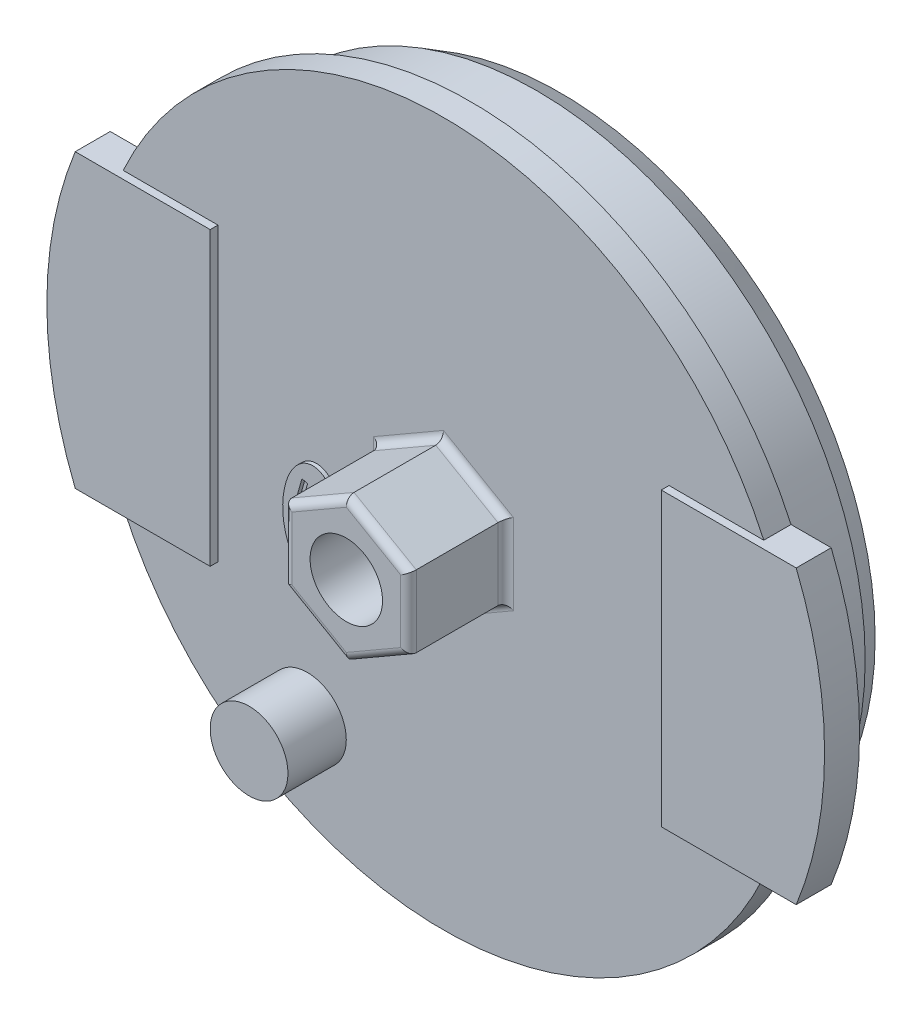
ISO-10303-21;
HEADER;
FILE_DESCRIPTION(('STEP AP214'),'2;1');
FILE_NAME('part.step','',(''),(''),'','','');
FILE_SCHEMA(('AUTOMOTIVE_DESIGN { 1 0 10303 214 1 1 1 1 }'));
ENDSEC;
DATA;
#1=APPLICATION_CONTEXT('core data for automotive mechanical design processes');
#2=APPLICATION_PROTOCOL_DEFINITION('international standard','automotive_design',2000,#1);
#3=PRODUCT_CONTEXT('',#1,'mechanical');
#4=PRODUCT('Part','Part','',(#3));
#5=PRODUCT_RELATED_PRODUCT_CATEGORY('part','',(#4));
#6=PRODUCT_DEFINITION_FORMATION('','',#4);
#7=PRODUCT_DEFINITION_CONTEXT('part definition',#1,'design');
#8=PRODUCT_DEFINITION('design','',#6,#7);
#9=PRODUCT_DEFINITION_SHAPE('','',#8);
#10=(LENGTH_UNIT() NAMED_UNIT(*) SI_UNIT(.MILLI.,.METRE.));
#11=(NAMED_UNIT(*) PLANE_ANGLE_UNIT() SI_UNIT($,.RADIAN.));
#12=(NAMED_UNIT(*) SI_UNIT($,.STERADIAN.) SOLID_ANGLE_UNIT());
#13=UNCERTAINTY_MEASURE_WITH_UNIT(LENGTH_MEASURE(1.E-05),#10,'distance_accuracy_value','');
#14=(GEOMETRIC_REPRESENTATION_CONTEXT(3) GLOBAL_UNCERTAINTY_ASSIGNED_CONTEXT((#13)) GLOBAL_UNIT_ASSIGNED_CONTEXT((#10,
#11,#12)) REPRESENTATION_CONTEXT('',''));
#15=CARTESIAN_POINT('',(0.,0.,0.));
#16=DIRECTION('',(0.,0.,1.));
#17=DIRECTION('',(1.,0.,0.));
#18=AXIS2_PLACEMENT_3D('',#15,#16,#17);
#19=CARTESIAN_POINT('',(0.,0.,30.));
#20=DIRECTION('',(0.,0.,1.));
#21=DIRECTION('',(1.,0.,0.));
#22=AXIS2_PLACEMENT_3D('',#19,#20,#21);
#23=PLANE('',#22);
#24=CARTESIAN_POINT('',(-34.9999999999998,-60.6217782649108,30.));
#25=DIRECTION('',(0.,0.,1.));
#26=DIRECTION('',(1.,0.,0.));
#27=AXIS2_PLACEMENT_3D('',#24,#25,#26);
#28=CIRCLE('',#27,9.99999999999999);
#29=CARTESIAN_POINT('',(-24.9999999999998,-60.6217782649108,30.));
#30=VERTEX_POINT('',#29);
#31=EDGE_CURVE('E1093',#30,#30,#28,.T.);
#32=ORIENTED_EDGE('',*,*,#31,.F.);
#33=EDGE_LOOP('',(#32));
#34=FACE_BOUND('',#33,.T.);
#35=DIRECTION('',(-1.,0.,0.));
#36=VECTOR('',#35,1.);
#37=CARTESIAN_POINT('',(0.,37.5,30.));
#38=LINE('',#37,#36);
#39=CARTESIAN_POINT('',(-58.,37.5,30.));
#40=VERTEX_POINT('',#39);
#41=CARTESIAN_POINT('',(-82.365041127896,37.5,30.));
#42=VERTEX_POINT('',#41);
#43=EDGE_CURVE('E1227',#40,#42,#38,.T.);
#44=ORIENTED_EDGE('',*,*,#43,.F.);
#45=DIRECTION('',(0.,-1.,0.));
#46=VECTOR('',#45,1.);
#47=CARTESIAN_POINT('',(-58.,0.,30.));
#48=LINE('',#47,#46);
#49=CARTESIAN_POINT('',(-58.,-37.5,30.));
#50=VERTEX_POINT('',#49);
#51=EDGE_CURVE('E1083',#40,#50,#48,.T.);
#52=ORIENTED_EDGE('',*,*,#51,.T.);
#53=DIRECTION('',(-1.,0.,0.));
#54=VECTOR('',#53,1.);
#55=CARTESIAN_POINT('',(0.,-37.5,30.));
#56=LINE('',#55,#54);
#57=CARTESIAN_POINT('',(-82.365041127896,-37.5,30.));
#58=VERTEX_POINT('',#57);
#59=EDGE_CURVE('E1234',#50,#58,#56,.T.);
#60=ORIENTED_EDGE('',*,*,#59,.T.);
#61=CARTESIAN_POINT('',(0.,0.,30.));
#62=DIRECTION('',(0.,0.,1.));
#63=DIRECTION('',(1.,0.,0.));
#64=AXIS2_PLACEMENT_3D('',#61,#62,#63);
#65=CIRCLE('',#64,90.5);
#66=CARTESIAN_POINT('',(82.365041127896,-37.5,30.));
#67=VERTEX_POINT('',#66);
#68=EDGE_CURVE('E1045',#58,#67,#65,.T.);
#69=ORIENTED_EDGE('',*,*,#68,.T.);
#70=DIRECTION('',(-1.,0.,0.));
#71=VECTOR('',#70,1.);
#72=CARTESIAN_POINT('',(0.,-37.5,30.));
#73=LINE('',#72,#71);
#74=CARTESIAN_POINT('',(58.,-37.5,30.));
#75=VERTEX_POINT('',#74);
#76=EDGE_CURVE('E1213',#67,#75,#73,.T.);
#77=ORIENTED_EDGE('',*,*,#76,.T.);
#78=DIRECTION('',(0.,1.,0.));
#79=VECTOR('',#78,1.);
#80=CARTESIAN_POINT('',(58.,0.,30.));
#81=LINE('',#80,#79);
#82=CARTESIAN_POINT('',(58.,37.5,30.));
#83=VERTEX_POINT('',#82);
#84=EDGE_CURVE('E1077',#75,#83,#81,.T.);
#85=ORIENTED_EDGE('',*,*,#84,.T.);
#86=DIRECTION('',(-1.,0.,0.));
#87=VECTOR('',#86,1.);
#88=CARTESIAN_POINT('',(0.,37.5,30.));
#89=LINE('',#88,#87);
#90=CARTESIAN_POINT('',(82.365041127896,37.5,30.));
#91=VERTEX_POINT('',#90);
#92=EDGE_CURVE('E1209',#91,#83,#89,.T.);
#93=ORIENTED_EDGE('',*,*,#92,.F.);
#94=EDGE_CURVE('E1054',#91,#42,#65,.T.);
#95=ORIENTED_EDGE('',*,*,#94,.T.);
#96=EDGE_LOOP('',(#44,#52,#60,#69,#77,#85,#93,#95));
#97=FACE_BOUND('',#96,.T.);
#98=DIRECTION('',(0.866025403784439,-0.5,0.));
#99=VECTOR('',#98,1.);
#100=CARTESIAN_POINT('',(-9.,-15.5884572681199,30.));
#101=LINE('',#100,#99);
#102=CARTESIAN_POINT('',(0.,-20.7846096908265,30.));
#103=VERTEX_POINT('',#102);
#104=CARTESIAN_POINT('',(-18.,-10.3923048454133,30.));
#105=VERTEX_POINT('',#104);
#106=EDGE_CURVE('E46',#103,#105,#101,.F.);
#107=ORIENTED_EDGE('',*,*,#106,.T.);
#108=DIRECTION('',(0.,-1.,0.));
#109=VECTOR('',#108,1.);
#110=CARTESIAN_POINT('',(-18.,0.,30.));
#111=LINE('',#110,#109);
#112=CARTESIAN_POINT('',(-18.,10.3923048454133,30.));
#113=VERTEX_POINT('',#112);
#114=EDGE_CURVE('E13',#105,#113,#111,.F.);
#115=ORIENTED_EDGE('',*,*,#114,.T.);
#116=DIRECTION('',(-0.866025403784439,-0.5,0.));
#117=VECTOR('',#116,1.);
#118=CARTESIAN_POINT('',(-9.,15.5884572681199,30.));
#119=LINE('',#118,#117);
#120=CARTESIAN_POINT('',(0.,20.7846096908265,30.));
#121=VERTEX_POINT('',#120);
#122=EDGE_CURVE('E1133',#113,#121,#119,.F.);
#123=ORIENTED_EDGE('',*,*,#122,.T.);
#124=DIRECTION('',(-0.866025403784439,0.5,0.));
#125=VECTOR('',#124,1.);
#126=CARTESIAN_POINT('',(9.,15.5884572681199,30.));
#127=LINE('',#126,#125);
#128=CARTESIAN_POINT('',(18.,10.3923048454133,30.));
#129=VERTEX_POINT('',#128);
#130=EDGE_CURVE('E1135',#121,#129,#127,.F.);
#131=ORIENTED_EDGE('',*,*,#130,.T.);
#132=DIRECTION('',(0.,1.,0.));
#133=VECTOR('',#132,1.);
#134=CARTESIAN_POINT('',(18.,0.,30.));
#135=LINE('',#134,#133);
#136=CARTESIAN_POINT('',(18.,-10.3923048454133,30.));
#137=VERTEX_POINT('',#136);
#138=EDGE_CURVE('E1137',#129,#137,#135,.F.);
#139=ORIENTED_EDGE('',*,*,#138,.T.);
#140=DIRECTION('',(0.866025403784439,0.5,0.));
#141=VECTOR('',#140,1.);
#142=CARTESIAN_POINT('',(9.,-15.5884572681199,30.));
#143=LINE('',#142,#141);
#144=EDGE_CURVE('E1139',#137,#103,#143,.F.);
#145=ORIENTED_EDGE('',*,*,#144,.T.);
#146=EDGE_LOOP('',(#107,#115,#123,#131,#139,#145));
#147=FACE_BOUND('',#146,.T.);
#148=CARTESIAN_POINT('',(-32.7437150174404,-15.7136643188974,29.9999999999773));
#149=DIRECTION('',(0.,0.,1.));
#150=DIRECTION('',(0.00915248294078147,0.999958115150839,0.));
#151=AXIS2_PLACEMENT_3D('',#148,#149,#150);
#152=ELLIPSE('',#151,12.8101888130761,7.60379428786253);
#153=CARTESIAN_POINT('',(-32.6264699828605,-2.90401205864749,29.9999999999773));
#154=VERTEX_POINT('',#153);
#155=EDGE_CURVE('E458',#154,#154,#152,.T.);
#156=ORIENTED_EDGE('',*,*,#155,.F.);
#157=EDGE_LOOP('',(#156));
#158=FACE_BOUND('',#157,.T.);
#159=ADVANCED_FACE('F37',(#34,#97,#147,#158),#23,.T.);
#160=CARTESIAN_POINT('',(0.,0.,23.));
#161=DIRECTION('',(0.,0.,1.));
#162=DIRECTION('',(1.,0.,0.));
#163=AXIS2_PLACEMENT_3D('',#160,#161,#162);
#164=PLANE('',#163);
#165=CARTESIAN_POINT('',(0.,0.,23.));
#166=DIRECTION('',(0.,0.,1.));
#167=DIRECTION('',(1.,0.,0.));
#168=AXIS2_PLACEMENT_3D('',#165,#166,#167);
#169=CIRCLE('',#168,84.5);
#170=CARTESIAN_POINT('',(84.5,0.,23.));
#171=VERTEX_POINT('',#170);
#172=EDGE_CURVE('E1065',#171,#171,#169,.T.);
#173=ORIENTED_EDGE('',*,*,#172,.T.);
#174=EDGE_LOOP('',(#173));
#175=FACE_BOUND('',#174,.T.);
#176=CARTESIAN_POINT('',(0.,0.,23.));
#177=DIRECTION('',(0.,0.,1.));
#178=DIRECTION('',(1.,0.,0.));
#179=AXIS2_PLACEMENT_3D('',#176,#177,#178);
#180=CIRCLE('',#179,100.);
#181=CARTESIAN_POINT('',(-92.7024810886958,37.5,23.));
#182=VERTEX_POINT('',#181);
#183=CARTESIAN_POINT('',(-92.7024810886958,-37.5,23.));
#184=VERTEX_POINT('',#183);
#185=EDGE_CURVE('E1264',#182,#184,#180,.T.);
#186=ORIENTED_EDGE('',*,*,#185,.F.);
#187=DIRECTION('',(-1.,0.,0.));
#188=VECTOR('',#187,1.);
#189=CARTESIAN_POINT('',(-100.,37.5,23.));
#190=LINE('',#189,#188);
#191=CARTESIAN_POINT('',(-82.365041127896,37.5,23.));
#192=VERTEX_POINT('',#191);
#193=EDGE_CURVE('E1239',#192,#182,#190,.T.);
#194=ORIENTED_EDGE('',*,*,#193,.F.);
#195=CARTESIAN_POINT('',(0.,0.,23.));
#196=DIRECTION('',(0.,0.,1.));
#197=DIRECTION('',(1.,0.,0.));
#198=AXIS2_PLACEMENT_3D('',#195,#196,#197);
#199=CIRCLE('',#198,90.5);
#200=CARTESIAN_POINT('',(82.365041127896,37.5,23.));
#201=VERTEX_POINT('',#200);
#202=EDGE_CURVE('E1064',#201,#192,#199,.T.);
#203=ORIENTED_EDGE('',*,*,#202,.F.);
#204=DIRECTION('',(-1.,0.,0.));
#205=VECTOR('',#204,1.);
#206=CARTESIAN_POINT('',(100.,37.5,23.));
#207=LINE('',#206,#205);
#208=CARTESIAN_POINT('',(92.7024810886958,37.5,23.));
#209=VERTEX_POINT('',#208);
#210=EDGE_CURVE('E1229',#209,#201,#207,.T.);
#211=ORIENTED_EDGE('',*,*,#210,.F.);
#212=CARTESIAN_POINT('',(92.7024810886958,-37.5,23.));
#213=VERTEX_POINT('',#212);
#214=EDGE_CURVE('E1258',#213,#209,#180,.T.);
#215=ORIENTED_EDGE('',*,*,#214,.F.);
#216=DIRECTION('',(-1.,0.,0.));
#217=VECTOR('',#216,1.);
#218=CARTESIAN_POINT('',(100.,-37.5,23.));
#219=LINE('',#218,#217);
#220=CARTESIAN_POINT('',(82.365041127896,-37.5,23.));
#221=VERTEX_POINT('',#220);
#222=EDGE_CURVE('E1222',#213,#221,#219,.T.);
#223=ORIENTED_EDGE('',*,*,#222,.T.);
#224=CARTESIAN_POINT('',(-82.365041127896,-37.5,23.));
#225=VERTEX_POINT('',#224);
#226=EDGE_CURVE('E1058',#225,#221,#199,.T.);
#227=ORIENTED_EDGE('',*,*,#226,.F.);
#228=DIRECTION('',(-1.,0.,0.));
#229=VECTOR('',#228,1.);
#230=CARTESIAN_POINT('',(-100.,-37.5,23.));
#231=LINE('',#230,#229);
#232=EDGE_CURVE('E1240',#225,#184,#231,.T.);
#233=ORIENTED_EDGE('',*,*,#232,.T.);
#234=EDGE_LOOP('',(#186,#194,#203,#211,#215,#223,#227,#233));
#235=FACE_BOUND('',#234,.T.);
#236=ADVANCED_FACE('F524',(#175,#235),#164,.F.);
#237=CARTESIAN_POINT('',(58.,37.5,32.));
#238=DIRECTION('',(0.,0.,-1.));
#239=DIRECTION('',(-1.,0.,0.));
#240=AXIS2_PLACEMENT_3D('',#237,#238,#239);
#241=PLANE('',#240);
#242=CARTESIAN_POINT('',(0.,0.,32.));
#243=DIRECTION('',(0.,0.,1.));
#244=DIRECTION('',(1.,0.,0.));
#245=AXIS2_PLACEMENT_3D('',#242,#243,#244);
#246=CIRCLE('',#245,100.);
#247=CARTESIAN_POINT('',(92.7024810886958,-37.5,32.));
#248=VERTEX_POINT('',#247);
#249=CARTESIAN_POINT('',(92.7024810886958,37.5,32.));
#250=VERTEX_POINT('',#249);
#251=EDGE_CURVE('E1266',#248,#250,#246,.T.);
#252=ORIENTED_EDGE('',*,*,#251,.T.);
#253=DIRECTION('',(1.,0.,0.));
#254=VECTOR('',#253,1.);
#255=CARTESIAN_POINT('',(58.,37.5,32.));
#256=LINE('',#255,#254);
#257=CARTESIAN_POINT('',(58.,37.5,32.));
#258=VERTEX_POINT('',#257);
#259=EDGE_CURVE('E1221',#258,#250,#256,.T.);
#260=ORIENTED_EDGE('',*,*,#259,.F.);
#261=DIRECTION('',(0.,-1.,0.));
#262=VECTOR('',#261,1.);
#263=CARTESIAN_POINT('',(58.,37.5,32.));
#264=LINE('',#263,#262);
#265=CARTESIAN_POINT('',(58.,-37.5,32.));
#266=VERTEX_POINT('',#265);
#267=EDGE_CURVE('E1215',#258,#266,#264,.T.);
#268=ORIENTED_EDGE('',*,*,#267,.T.);
#269=DIRECTION('',(1.,0.,0.));
#270=VECTOR('',#269,1.);
#271=CARTESIAN_POINT('',(58.,-37.5,32.));
#272=LINE('',#271,#270);
#273=EDGE_CURVE('E1224',#266,#248,#272,.T.);
#274=ORIENTED_EDGE('',*,*,#273,.T.);
#275=EDGE_LOOP('',(#252,#260,#268,#274));
#276=FACE_BOUND('',#275,.T.);
#277=ADVANCED_FACE('F513',(#276),#241,.F.);
#278=CARTESIAN_POINT('',(100.,37.5,32.));
#279=DIRECTION('',(0.,1.,0.));
#280=DIRECTION('',(0.,0.,1.));
#281=AXIS2_PLACEMENT_3D('',#278,#279,#280);
#282=PLANE('',#281);
#283=ORIENTED_EDGE('',*,*,#259,.T.);
#284=DIRECTION('',(0.,0.,1.));
#285=VECTOR('',#284,1.);
#286=CARTESIAN_POINT('',(92.7024810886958,37.5,0.));
#287=LINE('',#286,#285);
#288=EDGE_CURVE('E1249',#250,#209,#287,.F.);
#289=ORIENTED_EDGE('',*,*,#288,.T.);
#290=ORIENTED_EDGE('',*,*,#210,.T.);
#291=DIRECTION('',(0.,0.,1.));
#292=VECTOR('',#291,1.);
#293=CARTESIAN_POINT('',(82.365041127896,37.5,23.));
#294=LINE('',#293,#292);
#295=EDGE_CURVE('E1075',#201,#91,#294,.T.);
#296=ORIENTED_EDGE('',*,*,#295,.T.);
#297=ORIENTED_EDGE('',*,*,#92,.T.);
#298=DIRECTION('',(0.,0.,1.));
#299=VECTOR('',#298,1.);
#300=CARTESIAN_POINT('',(58.,37.5,23.));
#301=LINE('',#300,#299);
#302=EDGE_CURVE('E1218',#83,#258,#301,.T.);
#303=ORIENTED_EDGE('',*,*,#302,.T.);
#304=EDGE_LOOP('',(#283,#289,#290,#296,#297,#303));
#305=FACE_BOUND('',#304,.T.);
#306=ADVANCED_FACE('F510',(#305),#282,.T.);
#307=CARTESIAN_POINT('',(100.,-37.5,32.));
#308=DIRECTION('',(0.,1.,0.));
#309=DIRECTION('',(0.,0.,1.));
#310=AXIS2_PLACEMENT_3D('',#307,#308,#309);
#311=PLANE('',#310);
#312=DIRECTION('',(0.,0.,1.));
#313=VECTOR('',#312,1.);
#314=CARTESIAN_POINT('',(92.7024810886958,-37.5,0.));
#315=LINE('',#314,#313);
#316=EDGE_CURVE('E1259',#248,#213,#315,.F.);
#317=ORIENTED_EDGE('',*,*,#316,.F.);
#318=ORIENTED_EDGE('',*,*,#273,.F.);
#319=DIRECTION('',(0.,0.,1.));
#320=VECTOR('',#319,1.);
#321=CARTESIAN_POINT('',(58.,-37.5,23.));
#322=LINE('',#321,#320);
#323=EDGE_CURVE('E1219',#75,#266,#322,.T.);
#324=ORIENTED_EDGE('',*,*,#323,.F.);
#325=ORIENTED_EDGE('',*,*,#76,.F.);
#326=DIRECTION('',(0.,0.,1.));
#327=VECTOR('',#326,1.);
#328=CARTESIAN_POINT('',(82.365041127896,-37.5,23.));
#329=LINE('',#328,#327);
#330=EDGE_CURVE('E1050',#221,#67,#329,.T.);
#331=ORIENTED_EDGE('',*,*,#330,.F.);
#332=ORIENTED_EDGE('',*,*,#222,.F.);
#333=EDGE_LOOP('',(#317,#318,#324,#325,#331,#332));
#334=FACE_BOUND('',#333,.T.);
#335=ADVANCED_FACE('F508',(#334),#311,.F.);
#336=CARTESIAN_POINT('',(-58.,37.5,32.));
#337=DIRECTION('',(0.,0.,-1.));
#338=DIRECTION('',(-1.,0.,0.));
#339=AXIS2_PLACEMENT_3D('',#336,#337,#338);
#340=PLANE('',#339);
#341=CARTESIAN_POINT('',(-92.7024810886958,37.5,32.));
#342=VERTEX_POINT('',#341);
#343=CARTESIAN_POINT('',(-92.7024810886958,-37.5,32.));
#344=VERTEX_POINT('',#343);
#345=EDGE_CURVE('E1268',#342,#344,#246,.T.);
#346=ORIENTED_EDGE('',*,*,#345,.T.);
#347=DIRECTION('',(1.,0.,0.));
#348=VECTOR('',#347,1.);
#349=CARTESIAN_POINT('',(-58.,-37.5,32.));
#350=LINE('',#349,#348);
#351=CARTESIAN_POINT('',(-58.,-37.5,32.));
#352=VERTEX_POINT('',#351);
#353=EDGE_CURVE('E1247',#344,#352,#350,.T.);
#354=ORIENTED_EDGE('',*,*,#353,.T.);
#355=DIRECTION('',(0.,-1.,0.));
#356=VECTOR('',#355,1.);
#357=CARTESIAN_POINT('',(-58.,37.5,32.));
#358=LINE('',#357,#356);
#359=CARTESIAN_POINT('',(-58.,37.5,32.));
#360=VERTEX_POINT('',#359);
#361=EDGE_CURVE('E1236',#360,#352,#358,.T.);
#362=ORIENTED_EDGE('',*,*,#361,.F.);
#363=DIRECTION('',(1.,0.,0.));
#364=VECTOR('',#363,1.);
#365=CARTESIAN_POINT('',(-58.,37.5,32.));
#366=LINE('',#365,#364);
#367=EDGE_CURVE('E1243',#342,#360,#366,.T.);
#368=ORIENTED_EDGE('',*,*,#367,.F.);
#369=EDGE_LOOP('',(#346,#354,#362,#368));
#370=FACE_BOUND('',#369,.T.);
#371=ADVANCED_FACE('F495',(#370),#340,.F.);
#372=CARTESIAN_POINT('',(-58.,37.5,32.));
#373=DIRECTION('',(0.,1.,0.));
#374=DIRECTION('',(0.,0.,1.));
#375=AXIS2_PLACEMENT_3D('',#372,#373,#374);
#376=PLANE('',#375);
#377=ORIENTED_EDGE('',*,*,#193,.T.);
#378=DIRECTION('',(0.,0.,1.));
#379=VECTOR('',#378,1.);
#380=CARTESIAN_POINT('',(-92.7024810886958,37.5,0.));
#381=LINE('',#380,#379);
#382=EDGE_CURVE('E1261',#182,#342,#381,.T.);
#383=ORIENTED_EDGE('',*,*,#382,.T.);
#384=ORIENTED_EDGE('',*,*,#367,.T.);
#385=DIRECTION('',(0.,0.,-1.));
#386=VECTOR('',#385,1.);
#387=CARTESIAN_POINT('',(-58.,37.5,23.));
#388=LINE('',#387,#386);
#389=EDGE_CURVE('E1252',#360,#40,#388,.T.);
#390=ORIENTED_EDGE('',*,*,#389,.T.);
#391=ORIENTED_EDGE('',*,*,#43,.T.);
#392=DIRECTION('',(0.,0.,1.));
#393=VECTOR('',#392,1.);
#394=CARTESIAN_POINT('',(-82.365041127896,37.5,23.));
#395=LINE('',#394,#393);
#396=EDGE_CURVE('E1081',#42,#192,#395,.F.);
#397=ORIENTED_EDGE('',*,*,#396,.T.);
#398=EDGE_LOOP('',(#377,#383,#384,#390,#391,#397));
#399=FACE_BOUND('',#398,.T.);
#400=ADVANCED_FACE('F491',(#399),#376,.T.);
#401=CARTESIAN_POINT('',(-58.,-37.5,32.));
#402=DIRECTION('',(0.,1.,0.));
#403=DIRECTION('',(0.,0.,1.));
#404=AXIS2_PLACEMENT_3D('',#401,#402,#403);
#405=PLANE('',#404);
#406=DIRECTION('',(0.,0.,1.));
#407=VECTOR('',#406,1.);
#408=CARTESIAN_POINT('',(-92.7024810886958,-37.5,0.));
#409=LINE('',#408,#407);
#410=EDGE_CURVE('E1086',#184,#344,#409,.T.);
#411=ORIENTED_EDGE('',*,*,#410,.F.);
#412=ORIENTED_EDGE('',*,*,#232,.F.);
#413=DIRECTION('',(0.,0.,1.));
#414=VECTOR('',#413,1.);
#415=CARTESIAN_POINT('',(-82.365041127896,-37.5,23.));
#416=LINE('',#415,#414);
#417=EDGE_CURVE('E1047',#58,#225,#416,.F.);
#418=ORIENTED_EDGE('',*,*,#417,.F.);
#419=ORIENTED_EDGE('',*,*,#59,.F.);
#420=DIRECTION('',(0.,0.,-1.));
#421=VECTOR('',#420,1.);
#422=CARTESIAN_POINT('',(-58.,-37.5,23.));
#423=LINE('',#422,#421);
#424=EDGE_CURVE('E1244',#352,#50,#423,.T.);
#425=ORIENTED_EDGE('',*,*,#424,.F.);
#426=ORIENTED_EDGE('',*,*,#353,.F.);
#427=EDGE_LOOP('',(#411,#412,#418,#419,#425,#426));
#428=FACE_BOUND('',#427,.T.);
#429=ADVANCED_FACE('F494',(#428),#405,.F.);
#430=CARTESIAN_POINT('',(0.,0.,23.));
#431=DIRECTION('',(0.,0.,1.));
#432=DIRECTION('',(1.,0.,0.));
#433=AXIS2_PLACEMENT_3D('',#430,#431,#432);
#434=CYLINDRICAL_SURFACE('',#433,90.5);
#435=ORIENTED_EDGE('',*,*,#68,.F.);
#436=ORIENTED_EDGE('',*,*,#417,.T.);
#437=ORIENTED_EDGE('',*,*,#226,.T.);
#438=ORIENTED_EDGE('',*,*,#330,.T.);
#439=EDGE_LOOP('',(#435,#436,#437,#438));
#440=FACE_BOUND('',#439,.T.);
#441=ADVANCED_FACE('F499',(#440),#434,.T.);
#442=CARTESIAN_POINT('',(0.,0.,30.));
#443=DIRECTION('',(0.,0.,-1.));
#444=DIRECTION('',(-1.,0.,0.));
#445=AXIS2_PLACEMENT_3D('',#442,#443,#444);
#446=CYLINDRICAL_SURFACE('',#445,84.5);
#447=CARTESIAN_POINT('',(0.,0.,6.06217782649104));
#448=DIRECTION('',(0.,0.,1.));
#449=DIRECTION('',(1.,0.,0.));
#450=AXIS2_PLACEMENT_3D('',#447,#448,#449);
#451=CIRCLE('',#450,84.5);
#452=CARTESIAN_POINT('',(84.5,0.,6.06217782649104));
#453=VERTEX_POINT('',#452);
#454=EDGE_CURVE('E1068',#453,#453,#451,.T.);
#455=ORIENTED_EDGE('',*,*,#454,.T.);
#456=EDGE_LOOP('',(#455));
#457=FACE_BOUND('',#456,.T.);
#458=ORIENTED_EDGE('',*,*,#172,.F.);
#459=EDGE_LOOP('',(#458));
#460=FACE_BOUND('',#459,.T.);
#461=ADVANCED_FACE('F578',(#457,#460),#446,.T.);
#462=CARTESIAN_POINT('',(0.,0.,0.));
#463=DIRECTION('',(0.,0.,1.));
#464=DIRECTION('',(1.,0.,0.));
#465=AXIS2_PLACEMENT_3D('',#462,#463,#464);
#466=PLANE('',#465);
#467=CARTESIAN_POINT('',(0.,0.,0.));
#468=DIRECTION('',(0.,0.,1.));
#469=DIRECTION('',(1.,0.,0.));
#470=AXIS2_PLACEMENT_3D('',#467,#468,#469);
#471=CIRCLE('',#470,81.);
#472=CARTESIAN_POINT('',(81.,0.,0.));
#473=VERTEX_POINT('',#472);
#474=EDGE_CURVE('E1071',#473,#473,#471,.F.);
#475=ORIENTED_EDGE('',*,*,#474,.T.);
#476=EDGE_LOOP('',(#475));
#477=FACE_BOUND('',#476,.T.);
#478=CARTESIAN_POINT('',(0.,0.,0.));
#479=DIRECTION('',(0.,0.,-1.));
#480=DIRECTION('',(-1.,0.,0.));
#481=AXIS2_PLACEMENT_3D('',#478,#479,#480);
#482=CIRCLE('',#481,70.);
#483=CARTESIAN_POINT('',(-70.,0.,0.));
#484=VERTEX_POINT('',#483);
#485=EDGE_CURVE('E1206',#484,#484,#482,.T.);
#486=ORIENTED_EDGE('',*,*,#485,.F.);
#487=EDGE_LOOP('',(#486));
#488=FACE_BOUND('',#487,.T.);
#489=ADVANCED_FACE('F568',(#477,#488),#466,.F.);
#490=ORIENTED_EDGE('',*,*,#396,.F.);
#491=ORIENTED_EDGE('',*,*,#94,.F.);
#492=ORIENTED_EDGE('',*,*,#295,.F.);
#493=ORIENTED_EDGE('',*,*,#202,.T.);
#494=EDGE_LOOP('',(#490,#491,#492,#493));
#495=FACE_BOUND('',#494,.T.);
#496=ADVANCED_FACE('F561',(#495),#434,.T.);
#497=CARTESIAN_POINT('',(0.,18.475208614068,55.));
#498=DIRECTION('',(-0.5,-0.866025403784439,0.));
#499=DIRECTION('',(0.866025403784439,-0.5,0.));
#500=AXIS2_PLACEMENT_3D('',#497,#498,#499);
#501=PLANE('',#500);
#502=DIRECTION('',(0.,0.,-1.));
#503=VECTOR('',#502,1.);
#504=CARTESIAN_POINT('',(0.,18.475208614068,55.));
#505=LINE('',#504,#503);
#506=CARTESIAN_POINT('',(0.,18.475208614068,53.));
#507=VERTEX_POINT('',#506);
#508=CARTESIAN_POINT('',(0.,18.475208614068,32.));
#509=VERTEX_POINT('',#508);
#510=EDGE_CURVE('E1055',#507,#509,#505,.T.);
#511=ORIENTED_EDGE('',*,*,#510,.F.);
#512=DIRECTION('',(-0.866025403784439,0.5,0.));
#513=VECTOR('',#512,1.);
#514=CARTESIAN_POINT('',(0.,18.475208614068,53.));
#515=LINE('',#514,#513);
#516=CARTESIAN_POINT('',(16.,9.23760430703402,53.));
#517=VERTEX_POINT('',#516);
#518=EDGE_CURVE('E1131',#507,#517,#515,.F.);
#519=ORIENTED_EDGE('',*,*,#518,.T.);
#520=DIRECTION('',(0.,0.,-1.));
#521=VECTOR('',#520,1.);
#522=CARTESIAN_POINT('',(16.,9.23760430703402,55.));
#523=LINE('',#522,#521);
#524=CARTESIAN_POINT('',(16.,9.23760430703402,32.));
#525=VERTEX_POINT('',#524);
#526=EDGE_CURVE('E1202',#517,#525,#523,.T.);
#527=ORIENTED_EDGE('',*,*,#526,.T.);
#528=DIRECTION('',(-0.866025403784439,0.5,0.));
#529=VECTOR('',#528,1.);
#530=CARTESIAN_POINT('',(0.,18.475208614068,32.));
#531=LINE('',#530,#529);
#532=EDGE_CURVE('E1129',#525,#509,#531,.T.);
#533=ORIENTED_EDGE('',*,*,#532,.T.);
#534=EDGE_LOOP('',(#511,#519,#527,#533));
#535=FACE_BOUND('',#534,.T.);
#536=ADVANCED_FACE('F557',(#535),#501,.F.);
#537=CARTESIAN_POINT('',(0.,18.475208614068,55.));
#538=DIRECTION('',(0.5,-0.866025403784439,0.));
#539=DIRECTION('',(0.866025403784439,0.5,0.));
#540=AXIS2_PLACEMENT_3D('',#537,#538,#539);
#541=PLANE('',#540);
#542=DIRECTION('',(0.,0.,-1.));
#543=VECTOR('',#542,1.);
#544=CARTESIAN_POINT('',(-16.,9.23760430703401,55.));
#545=LINE('',#544,#543);
#546=CARTESIAN_POINT('',(-16.,9.23760430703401,53.));
#547=VERTEX_POINT('',#546);
#548=CARTESIAN_POINT('',(-16.,9.23760430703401,32.));
#549=VERTEX_POINT('',#548);
#550=EDGE_CURVE('E1060',#547,#549,#545,.T.);
#551=ORIENTED_EDGE('',*,*,#550,.F.);
#552=DIRECTION('',(-0.866025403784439,-0.5,0.));
#553=VECTOR('',#552,1.);
#554=CARTESIAN_POINT('',(0.,18.475208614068,53.));
#555=LINE('',#554,#553);
#556=EDGE_CURVE('E1127',#547,#507,#555,.F.);
#557=ORIENTED_EDGE('',*,*,#556,.T.);
#558=ORIENTED_EDGE('',*,*,#510,.T.);
#559=DIRECTION('',(-0.866025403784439,-0.5,0.));
#560=VECTOR('',#559,1.);
#561=CARTESIAN_POINT('',(0.,18.475208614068,32.));
#562=LINE('',#561,#560);
#563=EDGE_CURVE('E1125',#509,#549,#562,.T.);
#564=ORIENTED_EDGE('',*,*,#563,.T.);
#565=EDGE_LOOP('',(#551,#557,#558,#564));
#566=FACE_BOUND('',#565,.T.);
#567=ADVANCED_FACE('F553',(#566),#541,.F.);
#568=CARTESIAN_POINT('',(-16.,9.23760430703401,55.));
#569=DIRECTION('',(1.,0.,0.));
#570=DIRECTION('',(0.,1.,0.));
#571=AXIS2_PLACEMENT_3D('',#568,#569,#570);
#572=PLANE('',#571);
#573=DIRECTION('',(0.,0.,-1.));
#574=VECTOR('',#573,1.);
#575=CARTESIAN_POINT('',(-16.,-9.23760430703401,55.));
#576=LINE('',#575,#574);
#577=CARTESIAN_POINT('',(-16.,-9.23760430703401,53.));
#578=VERTEX_POINT('',#577);
#579=CARTESIAN_POINT('',(-16.,-9.23760430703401,32.));
#580=VERTEX_POINT('',#579);
#581=EDGE_CURVE('E1192',#578,#580,#576,.T.);
#582=ORIENTED_EDGE('',*,*,#581,.F.);
#583=DIRECTION('',(0.,-1.,0.));
#584=VECTOR('',#583,1.);
#585=CARTESIAN_POINT('',(-16.,9.23760430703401,53.));
#586=LINE('',#585,#584);
#587=EDGE_CURVE('E1123',#578,#547,#586,.F.);
#588=ORIENTED_EDGE('',*,*,#587,.T.);
#589=ORIENTED_EDGE('',*,*,#550,.T.);
#590=DIRECTION('',(0.,-1.,0.));
#591=VECTOR('',#590,1.);
#592=CARTESIAN_POINT('',(-16.,9.23760430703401,32.));
#593=LINE('',#592,#591);
#594=EDGE_CURVE('E1120',#549,#580,#593,.T.);
#595=ORIENTED_EDGE('',*,*,#594,.T.);
#596=EDGE_LOOP('',(#582,#588,#589,#595));
#597=FACE_BOUND('',#596,.T.);
#598=ADVANCED_FACE('F549',(#597),#572,.F.);
#599=CARTESIAN_POINT('',(-16.,-9.23760430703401,55.));
#600=DIRECTION('',(0.5,0.866025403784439,0.));
#601=DIRECTION('',(-0.866025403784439,0.5,0.));
#602=AXIS2_PLACEMENT_3D('',#599,#600,#601);
#603=PLANE('',#602);
#604=DIRECTION('',(0.,0.,-1.));
#605=VECTOR('',#604,1.);
#606=CARTESIAN_POINT('',(0.,-18.475208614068,55.));
#607=LINE('',#606,#605);
#608=CARTESIAN_POINT('',(0.,-18.475208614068,53.));
#609=VERTEX_POINT('',#608);
#610=CARTESIAN_POINT('',(0.,-18.475208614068,32.));
#611=VERTEX_POINT('',#610);
#612=EDGE_CURVE('E1194',#609,#611,#607,.T.);
#613=ORIENTED_EDGE('',*,*,#612,.F.);
#614=DIRECTION('',(0.866025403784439,-0.5,0.));
#615=VECTOR('',#614,1.);
#616=CARTESIAN_POINT('',(-16.,-9.23760430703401,53.));
#617=LINE('',#616,#615);
#618=EDGE_CURVE('E1118',#609,#578,#617,.F.);
#619=ORIENTED_EDGE('',*,*,#618,.T.);
#620=ORIENTED_EDGE('',*,*,#581,.T.);
#621=DIRECTION('',(0.866025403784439,-0.5,0.));
#622=VECTOR('',#621,1.);
#623=CARTESIAN_POINT('',(-16.,-9.23760430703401,32.));
#624=LINE('',#623,#622);
#625=EDGE_CURVE('E1116',#580,#611,#624,.T.);
#626=ORIENTED_EDGE('',*,*,#625,.T.);
#627=EDGE_LOOP('',(#613,#619,#620,#626));
#628=FACE_BOUND('',#627,.T.);
#629=ADVANCED_FACE('F545',(#628),#603,.F.);
#630=CARTESIAN_POINT('',(16.,-9.23760430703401,55.));
#631=DIRECTION('',(-0.5,0.866025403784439,0.));
#632=DIRECTION('',(-0.866025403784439,-0.5,0.));
#633=AXIS2_PLACEMENT_3D('',#630,#631,#632);
#634=PLANE('',#633);
#635=DIRECTION('',(0.,0.,-1.));
#636=VECTOR('',#635,1.);
#637=CARTESIAN_POINT('',(16.,-9.23760430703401,55.));
#638=LINE('',#637,#636);
#639=CARTESIAN_POINT('',(16.,-9.23760430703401,53.));
#640=VERTEX_POINT('',#639);
#641=CARTESIAN_POINT('',(16.,-9.23760430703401,32.));
#642=VERTEX_POINT('',#641);
#643=EDGE_CURVE('E1199',#640,#642,#638,.T.);
#644=ORIENTED_EDGE('',*,*,#643,.F.);
#645=DIRECTION('',(0.866025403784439,0.5,0.));
#646=VECTOR('',#645,1.);
#647=CARTESIAN_POINT('',(16.,-9.23760430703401,53.));
#648=LINE('',#647,#646);
#649=EDGE_CURVE('E1114',#640,#609,#648,.F.);
#650=ORIENTED_EDGE('',*,*,#649,.T.);
#651=ORIENTED_EDGE('',*,*,#612,.T.);
#652=DIRECTION('',(0.866025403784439,0.5,0.));
#653=VECTOR('',#652,1.);
#654=CARTESIAN_POINT('',(16.,-9.23760430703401,32.));
#655=LINE('',#654,#653);
#656=EDGE_CURVE('E1112',#611,#642,#655,.T.);
#657=ORIENTED_EDGE('',*,*,#656,.T.);
#658=EDGE_LOOP('',(#644,#650,#651,#657));
#659=FACE_BOUND('',#658,.T.);
#660=ADVANCED_FACE('F541',(#659),#634,.F.);
#661=CARTESIAN_POINT('',(16.,9.23760430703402,55.));
#662=DIRECTION('',(-1.,0.,0.));
#663=DIRECTION('',(0.,0.,1.));
#664=AXIS2_PLACEMENT_3D('',#661,#662,#663);
#665=PLANE('',#664);
#666=ORIENTED_EDGE('',*,*,#526,.F.);
#667=DIRECTION('',(0.,1.,0.));
#668=VECTOR('',#667,1.);
#669=CARTESIAN_POINT('',(16.,9.23760430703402,53.));
#670=LINE('',#669,#668);
#671=EDGE_CURVE('E1109',#517,#640,#670,.F.);
#672=ORIENTED_EDGE('',*,*,#671,.T.);
#673=ORIENTED_EDGE('',*,*,#643,.T.);
#674=DIRECTION('',(0.,1.,0.));
#675=VECTOR('',#674,1.);
#676=CARTESIAN_POINT('',(16.,9.23760430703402,32.));
#677=LINE('',#676,#675);
#678=EDGE_CURVE('E1107',#642,#525,#677,.T.);
#679=ORIENTED_EDGE('',*,*,#678,.T.);
#680=EDGE_LOOP('',(#666,#672,#673,#679));
#681=FACE_BOUND('',#680,.T.);
#682=ADVANCED_FACE('F537',(#681),#665,.F.);
#683=CARTESIAN_POINT('',(16.,9.23760430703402,55.));
#684=DIRECTION('',(0.,0.,-1.));
#685=DIRECTION('',(-1.,0.,0.));
#686=AXIS2_PLACEMENT_3D('',#683,#684,#685);
#687=PLANE('',#686);
#688=DIRECTION('',(0.866025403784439,0.5,0.));
#689=VECTOR('',#688,1.);
#690=CARTESIAN_POINT('',(23.,-2.88675134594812,55.));
#691=LINE('',#690,#689);
#692=CARTESIAN_POINT('',(0.,-16.1658075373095,55.));
#693=VERTEX_POINT('',#692);
#694=CARTESIAN_POINT('',(14.,-8.08290376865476,55.));
#695=VERTEX_POINT('',#694);
#696=EDGE_CURVE('E1102',#693,#695,#691,.T.);
#697=ORIENTED_EDGE('',*,*,#696,.T.);
#698=DIRECTION('',(0.,1.,0.));
#699=VECTOR('',#698,1.);
#700=CARTESIAN_POINT('',(14.,9.23760430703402,55.));
#701=LINE('',#700,#699);
#702=CARTESIAN_POINT('',(14.,8.08290376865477,55.));
#703=VERTEX_POINT('',#702);
#704=EDGE_CURVE('E1104',#695,#703,#701,.T.);
#705=ORIENTED_EDGE('',*,*,#704,.T.);
#706=DIRECTION('',(-0.866025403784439,0.5,0.));
#707=VECTOR('',#706,1.);
#708=CARTESIAN_POINT('',(15.,7.50555349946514,55.));
#709=LINE('',#708,#707);
#710=CARTESIAN_POINT('',(0.,16.1658075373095,55.));
#711=VERTEX_POINT('',#710);
#712=EDGE_CURVE('E1089',#703,#711,#709,.T.);
#713=ORIENTED_EDGE('',*,*,#712,.T.);
#714=DIRECTION('',(-0.866025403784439,-0.5,0.));
#715=VECTOR('',#714,1.);
#716=CARTESIAN_POINT('',(9.00000000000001,21.3619599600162,55.));
#717=LINE('',#716,#715);
#718=CARTESIAN_POINT('',(-14.,8.08290376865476,55.));
#719=VERTEX_POINT('',#718);
#720=EDGE_CURVE('E1096',#711,#719,#717,.T.);
#721=ORIENTED_EDGE('',*,*,#720,.T.);
#722=DIRECTION('',(0.,-1.,0.));
#723=VECTOR('',#722,1.);
#724=CARTESIAN_POINT('',(-14.,9.23760430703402,55.));
#725=LINE('',#724,#723);
#726=CARTESIAN_POINT('',(-14.,-8.08290376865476,55.));
#727=VERTEX_POINT('',#726);
#728=EDGE_CURVE('E1098',#719,#727,#725,.T.);
#729=ORIENTED_EDGE('',*,*,#728,.T.);
#730=DIRECTION('',(0.866025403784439,-0.5,0.));
#731=VECTOR('',#730,1.);
#732=CARTESIAN_POINT('',(0.99999999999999,-16.7431578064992,55.));
#733=LINE('',#732,#731);
#734=EDGE_CURVE('E1100',#727,#693,#733,.T.);
#735=ORIENTED_EDGE('',*,*,#734,.T.);
#736=EDGE_LOOP('',(#697,#705,#713,#721,#729,#735));
#737=FACE_BOUND('',#736,.T.);
#738=CARTESIAN_POINT('',(0.,0.,55.));
#739=DIRECTION('',(0.,0.,1.));
#740=DIRECTION('',(1.,0.,0.));
#741=AXIS2_PLACEMENT_3D('',#738,#739,#740);
#742=CIRCLE('',#741,9.315);
#743=CARTESIAN_POINT('',(9.315,0.,55.));
#744=VERTEX_POINT('',#743);
#745=EDGE_CURVE('E1094',#744,#744,#742,.T.);
#746=ORIENTED_EDGE('',*,*,#745,.F.);
#747=EDGE_LOOP('',(#746));
#748=FACE_BOUND('',#747,.T.);
#749=ADVANCED_FACE('F533',(#737,#748),#687,.F.);
#750=CARTESIAN_POINT('',(0.,0.,20.));
#751=DIRECTION('',(0.,0.,-1.));
#752=DIRECTION('',(-1.,0.,0.));
#753=AXIS2_PLACEMENT_3D('',#750,#751,#752);
#754=CYLINDRICAL_SURFACE('',#753,70.);
#755=CARTESIAN_POINT('',(0.,0.,20.));
#756=DIRECTION('',(0.,0.,-1.));
#757=DIRECTION('',(-1.,0.,0.));
#758=AXIS2_PLACEMENT_3D('',#755,#756,#757);
#759=CIRCLE('',#758,70.);
#760=CARTESIAN_POINT('',(-70.,0.,20.));
#761=VERTEX_POINT('',#760);
#762=EDGE_CURVE('E1205',#761,#761,#759,.T.);
#763=ORIENTED_EDGE('',*,*,#762,.F.);
#764=EDGE_LOOP('',(#763));
#765=FACE_BOUND('',#764,.T.);
#766=ORIENTED_EDGE('',*,*,#485,.T.);
#767=EDGE_LOOP('',(#766));
#768=FACE_BOUND('',#767,.T.);
#769=ADVANCED_FACE('F529',(#765,#768),#754,.F.);
#770=CARTESIAN_POINT('',(0.,0.,20.));
#771=DIRECTION('',(0.,0.,-1.));
#772=DIRECTION('',(-1.,0.,0.));
#773=AXIS2_PLACEMENT_3D('',#770,#771,#772);
#774=PLANE('',#773);
#775=CARTESIAN_POINT('',(0.,0.,20.));
#776=DIRECTION('',(0.,0.,-1.));
#777=DIRECTION('',(-1.,0.,0.));
#778=AXIS2_PLACEMENT_3D('',#775,#776,#777);
#779=CIRCLE('',#778,9.315);
#780=CARTESIAN_POINT('',(-9.315,0.,20.));
#781=VERTEX_POINT('',#780);
#782=EDGE_CURVE('E1090',#781,#781,#779,.T.);
#783=ORIENTED_EDGE('',*,*,#782,.F.);
#784=EDGE_LOOP('',(#783));
#785=FACE_BOUND('',#784,.T.);
#786=ORIENTED_EDGE('',*,*,#762,.T.);
#787=EDGE_LOOP('',(#786));
#788=FACE_BOUND('',#787,.T.);
#789=ADVANCED_FACE('F526',(#785,#788),#774,.T.);
#790=CARTESIAN_POINT('',(0.,0.,6.06217782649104));
#791=DIRECTION('',(0.,0.,1.));
#792=DIRECTION('',(1.,0.,0.));
#793=AXIS2_PLACEMENT_3D('',#790,#791,#792);
#794=CONICAL_SURFACE('',#793,84.5,0.523598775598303);
#795=ORIENTED_EDGE('',*,*,#474,.F.);
#796=EDGE_LOOP('',(#795));
#797=FACE_BOUND('',#796,.T.);
#798=ORIENTED_EDGE('',*,*,#454,.F.);
#799=EDGE_LOOP('',(#798));
#800=FACE_BOUND('',#799,.T.);
#801=ADVANCED_FACE('F520',(#797,#800),#794,.T.);
#802=CARTESIAN_POINT('',(58.,37.5,23.));
#803=DIRECTION('',(1.,0.,0.));
#804=DIRECTION('',(0.,0.,-1.));
#805=AXIS2_PLACEMENT_3D('',#802,#803,#804);
#806=PLANE('',#805);
#807=ORIENTED_EDGE('',*,*,#84,.F.);
#808=ORIENTED_EDGE('',*,*,#323,.T.);
#809=ORIENTED_EDGE('',*,*,#267,.F.);
#810=ORIENTED_EDGE('',*,*,#302,.F.);
#811=EDGE_LOOP('',(#807,#808,#809,#810));
#812=FACE_BOUND('',#811,.T.);
#813=ADVANCED_FACE('F504',(#812),#806,.F.);
#814=CARTESIAN_POINT('',(-58.,37.5,23.));
#815=DIRECTION('',(-1.,0.,0.));
#816=DIRECTION('',(0.,0.,1.));
#817=AXIS2_PLACEMENT_3D('',#814,#815,#816);
#818=PLANE('',#817);
#819=ORIENTED_EDGE('',*,*,#51,.F.);
#820=ORIENTED_EDGE('',*,*,#389,.F.);
#821=ORIENTED_EDGE('',*,*,#361,.T.);
#822=ORIENTED_EDGE('',*,*,#424,.T.);
#823=EDGE_LOOP('',(#819,#820,#821,#822));
#824=FACE_BOUND('',#823,.T.);
#825=ADVANCED_FACE('F501',(#824),#818,.F.);
#826=CARTESIAN_POINT('',(0.,0.,0.));
#827=DIRECTION('',(0.,0.,1.));
#828=DIRECTION('',(1.,0.,0.));
#829=AXIS2_PLACEMENT_3D('',#826,#827,#828);
#830=CYLINDRICAL_SURFACE('',#829,100.);
#831=ORIENTED_EDGE('',*,*,#185,.T.);
#832=ORIENTED_EDGE('',*,*,#410,.T.);
#833=ORIENTED_EDGE('',*,*,#345,.F.);
#834=ORIENTED_EDGE('',*,*,#382,.F.);
#835=EDGE_LOOP('',(#831,#832,#833,#834));
#836=FACE_BOUND('',#835,.T.);
#837=ADVANCED_FACE('F489',(#836),#830,.T.);
#838=ORIENTED_EDGE('',*,*,#214,.T.);
#839=ORIENTED_EDGE('',*,*,#288,.F.);
#840=ORIENTED_EDGE('',*,*,#251,.F.);
#841=ORIENTED_EDGE('',*,*,#316,.T.);
#842=EDGE_LOOP('',(#838,#839,#840,#841));
#843=FACE_BOUND('',#842,.T.);
#844=ADVANCED_FACE('F485',(#843),#830,.T.);
#845=CARTESIAN_POINT('',(-34.9999999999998,-60.6217782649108,45.));
#846=DIRECTION('',(0.,0.,-1.));
#847=DIRECTION('',(-1.,0.,0.));
#848=AXIS2_PLACEMENT_3D('',#845,#846,#847);
#849=CYLINDRICAL_SURFACE('',#848,9.99999999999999);
#850=CARTESIAN_POINT('',(-34.9999999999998,-60.6217782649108,45.));
#851=DIRECTION('',(0.,0.,1.));
#852=DIRECTION('',(1.,0.,0.));
#853=AXIS2_PLACEMENT_3D('',#850,#851,#852);
#854=CIRCLE('',#853,9.99999999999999);
#855=CARTESIAN_POINT('',(-24.9999999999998,-60.6217782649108,45.));
#856=VERTEX_POINT('',#855);
#857=EDGE_CURVE('E1269',#856,#856,#854,.T.);
#858=ORIENTED_EDGE('',*,*,#857,.F.);
#859=EDGE_LOOP('',(#858));
#860=FACE_BOUND('',#859,.T.);
#861=ORIENTED_EDGE('',*,*,#31,.T.);
#862=EDGE_LOOP('',(#861));
#863=FACE_BOUND('',#862,.T.);
#864=ADVANCED_FACE('F481',(#860,#863),#849,.T.);
#865=CARTESIAN_POINT('',(-34.9999999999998,-60.6217782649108,45.));
#866=DIRECTION('',(0.,0.,1.));
#867=DIRECTION('',(1.,0.,0.));
#868=AXIS2_PLACEMENT_3D('',#865,#866,#867);
#869=PLANE('',#868);
#870=ORIENTED_EDGE('',*,*,#857,.T.);
#871=EDGE_LOOP('',(#870));
#872=FACE_BOUND('',#871,.T.);
#873=ADVANCED_FACE('F477',(#872),#869,.T.);
#874=CARTESIAN_POINT('',(0.,0.,0.));
#875=DIRECTION('',(0.,0.,1.));
#876=DIRECTION('',(1.,0.,0.));
#877=AXIS2_PLACEMENT_3D('',#874,#875,#876);
#878=CYLINDRICAL_SURFACE('',#877,9.315);
#879=ORIENTED_EDGE('',*,*,#782,.T.);
#880=EDGE_LOOP('',(#879));
#881=FACE_BOUND('',#880,.T.);
#882=ORIENTED_EDGE('',*,*,#745,.T.);
#883=EDGE_LOOP('',(#882));
#884=FACE_BOUND('',#883,.T.);
#885=ADVANCED_FACE('F473',(#881,#884),#878,.F.);
#886=CARTESIAN_POINT('',(-14.,9.23760430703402,53.));
#887=DIRECTION('',(0.,-1.,0.));
#888=DIRECTION('',(1.,0.,0.));
#889=AXIS2_PLACEMENT_3D('',#886,#887,#888);
#890=CYLINDRICAL_SURFACE('',#889,2.);
#891=CARTESIAN_POINT('',(-14.,8.08290376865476,53.));
#892=DIRECTION('',(-0.5,-0.866025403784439,0.));
#893=DIRECTION('',(-0.866025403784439,0.5,0.));
#894=AXIS2_PLACEMENT_3D('',#891,#892,#893);
#895=ELLIPSE('',#894,2.3094010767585,2.);
#896=EDGE_CURVE('E1152',#547,#719,#895,.F.);
#897=ORIENTED_EDGE('',*,*,#896,.F.);
#898=ORIENTED_EDGE('',*,*,#587,.F.);
#899=CARTESIAN_POINT('',(-14.,-8.08290376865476,53.));
#900=DIRECTION('',(0.5,-0.866025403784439,0.));
#901=DIRECTION('',(-0.866025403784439,-0.5,0.));
#902=AXIS2_PLACEMENT_3D('',#899,#900,#901);
#903=ELLIPSE('',#902,2.3094010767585,2.);
#904=EDGE_CURVE('E1155',#727,#578,#903,.T.);
#905=ORIENTED_EDGE('',*,*,#904,.F.);
#906=ORIENTED_EDGE('',*,*,#728,.F.);
#907=EDGE_LOOP('',(#897,#898,#905,#906));
#908=FACE_BOUND('',#907,.T.);
#909=ADVANCED_FACE('F476',(#908),#890,.T.);
#910=CARTESIAN_POINT('',(0.999999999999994,-16.7431578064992,53.));
#911=DIRECTION('',(0.866025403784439,-0.5,0.));
#912=DIRECTION('',(0.5,0.866025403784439,0.));
#913=AXIS2_PLACEMENT_3D('',#910,#911,#912);
#914=CYLINDRICAL_SURFACE('',#913,2.);
#915=ORIENTED_EDGE('',*,*,#904,.T.);
#916=ORIENTED_EDGE('',*,*,#618,.F.);
#917=CARTESIAN_POINT('',(0.,-16.1658075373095,53.));
#918=DIRECTION('',(1.,0.,0.));
#919=DIRECTION('',(0.,-1.,0.));
#920=AXIS2_PLACEMENT_3D('',#917,#918,#919);
#921=ELLIPSE('',#920,2.3094010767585,2.);
#922=EDGE_CURVE('E1149',#693,#609,#921,.T.);
#923=ORIENTED_EDGE('',*,*,#922,.F.);
#924=ORIENTED_EDGE('',*,*,#734,.F.);
#925=EDGE_LOOP('',(#915,#916,#923,#924));
#926=FACE_BOUND('',#925,.T.);
#927=ADVANCED_FACE('F601',(#926),#914,.T.);
#928=CARTESIAN_POINT('',(9.00000000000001,21.3619599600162,53.));
#929=DIRECTION('',(-0.866025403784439,-0.5,0.));
#930=DIRECTION('',(0.5,-0.866025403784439,0.));
#931=AXIS2_PLACEMENT_3D('',#928,#929,#930);
#932=CYLINDRICAL_SURFACE('',#931,2.);
#933=ORIENTED_EDGE('',*,*,#896,.T.);
#934=ORIENTED_EDGE('',*,*,#720,.F.);
#935=CARTESIAN_POINT('',(0.,16.1658075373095,53.));
#936=DIRECTION('',(-1.,0.,0.));
#937=DIRECTION('',(0.,1.,0.));
#938=AXIS2_PLACEMENT_3D('',#935,#936,#937);
#939=ELLIPSE('',#938,2.3094010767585,2.);
#940=EDGE_CURVE('E1146',#507,#711,#939,.F.);
#941=ORIENTED_EDGE('',*,*,#940,.F.);
#942=ORIENTED_EDGE('',*,*,#556,.F.);
#943=EDGE_LOOP('',(#933,#934,#941,#942));
#944=FACE_BOUND('',#943,.T.);
#945=ADVANCED_FACE('F597',(#944),#932,.T.);
#946=CARTESIAN_POINT('',(23.,-2.88675134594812,53.));
#947=DIRECTION('',(0.866025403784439,0.5,0.));
#948=DIRECTION('',(-0.5,0.866025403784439,0.));
#949=AXIS2_PLACEMENT_3D('',#946,#947,#948);
#950=CYLINDRICAL_SURFACE('',#949,2.);
#951=ORIENTED_EDGE('',*,*,#922,.T.);
#952=ORIENTED_EDGE('',*,*,#649,.F.);
#953=CARTESIAN_POINT('',(14.,-8.08290376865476,53.));
#954=DIRECTION('',(0.5,0.866025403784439,0.));
#955=DIRECTION('',(0.866025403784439,-0.5,0.));
#956=AXIS2_PLACEMENT_3D('',#953,#954,#955);
#957=ELLIPSE('',#956,2.3094010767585,2.);
#958=EDGE_CURVE('E1144',#695,#640,#957,.T.);
#959=ORIENTED_EDGE('',*,*,#958,.F.);
#960=ORIENTED_EDGE('',*,*,#696,.F.);
#961=EDGE_LOOP('',(#951,#952,#959,#960));
#962=FACE_BOUND('',#961,.T.);
#963=ADVANCED_FACE('F593',(#962),#950,.T.);
#964=CARTESIAN_POINT('',(15.,7.50555349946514,53.));
#965=DIRECTION('',(-0.866025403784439,0.5,0.));
#966=DIRECTION('',(-0.5,-0.866025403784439,0.));
#967=AXIS2_PLACEMENT_3D('',#964,#965,#966);
#968=CYLINDRICAL_SURFACE('',#967,2.);
#969=ORIENTED_EDGE('',*,*,#940,.T.);
#970=ORIENTED_EDGE('',*,*,#712,.F.);
#971=CARTESIAN_POINT('',(14.,8.08290376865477,53.));
#972=DIRECTION('',(-0.5,0.866025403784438,0.));
#973=DIRECTION('',(-0.866025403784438,-0.5,0.));
#974=AXIS2_PLACEMENT_3D('',#971,#972,#973);
#975=ELLIPSE('',#974,2.3094010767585,2.);
#976=EDGE_CURVE('E1142',#517,#703,#975,.F.);
#977=ORIENTED_EDGE('',*,*,#976,.F.);
#978=ORIENTED_EDGE('',*,*,#518,.F.);
#979=EDGE_LOOP('',(#969,#970,#977,#978));
#980=FACE_BOUND('',#979,.T.);
#981=ADVANCED_FACE('F589',(#980),#968,.T.);
#982=CARTESIAN_POINT('',(14.,9.23760430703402,53.));
#983=DIRECTION('',(0.,1.,0.));
#984=DIRECTION('',(0.,0.,1.));
#985=AXIS2_PLACEMENT_3D('',#982,#983,#984);
#986=CYLINDRICAL_SURFACE('',#985,2.);
#987=ORIENTED_EDGE('',*,*,#958,.T.);
#988=ORIENTED_EDGE('',*,*,#671,.F.);
#989=ORIENTED_EDGE('',*,*,#976,.T.);
#990=ORIENTED_EDGE('',*,*,#704,.F.);
#991=EDGE_LOOP('',(#987,#988,#989,#990));
#992=FACE_BOUND('',#991,.T.);
#993=ADVANCED_FACE('F586',(#992),#986,.T.);
#994=CARTESIAN_POINT('',(18.,9.23760430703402,32.));
#995=DIRECTION('',(0.,1.,0.));
#996=DIRECTION('',(0.,0.,1.));
#997=AXIS2_PLACEMENT_3D('',#994,#995,#996);
#998=CYLINDRICAL_SURFACE('',#997,2.);
#999=CARTESIAN_POINT('',(18.,-10.3923048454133,32.));
#1000=DIRECTION('',(0.5,0.866025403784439,0.));
#1001=DIRECTION('',(-0.866025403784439,0.5,0.));
#1002=AXIS2_PLACEMENT_3D('',#999,#1000,#1001);
#1003=ELLIPSE('',#1002,2.3094010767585,2.);
#1004=EDGE_CURVE('E1166',#137,#642,#1003,.T.);
#1005=ORIENTED_EDGE('',*,*,#1004,.F.);
#1006=ORIENTED_EDGE('',*,*,#138,.F.);
#1007=CARTESIAN_POINT('',(18.,10.3923048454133,32.));
#1008=DIRECTION('',(-0.5,0.866025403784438,0.));
#1009=DIRECTION('',(-0.866025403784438,-0.5,0.));
#1010=AXIS2_PLACEMENT_3D('',#1007,#1008,#1009);
#1011=ELLIPSE('',#1010,2.3094010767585,2.);
#1012=EDGE_CURVE('E41',#525,#129,#1011,.F.);
#1013=ORIENTED_EDGE('',*,*,#1012,.F.);
#1014=ORIENTED_EDGE('',*,*,#678,.F.);
#1015=EDGE_LOOP('',(#1005,#1006,#1013,#1014));
#1016=FACE_BOUND('',#1015,.T.);
#1017=ADVANCED_FACE('F39',(#1016),#998,.F.);
#1018=CARTESIAN_POINT('',(1.,20.2072594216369,32.));
#1019=DIRECTION('',(-0.866025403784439,0.5,0.));
#1020=DIRECTION('',(-0.5,-0.866025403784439,0.));
#1021=AXIS2_PLACEMENT_3D('',#1018,#1019,#1020);
#1022=CYLINDRICAL_SURFACE('',#1021,2.);
#1023=ORIENTED_EDGE('',*,*,#1012,.T.);
#1024=ORIENTED_EDGE('',*,*,#130,.F.);
#1025=CARTESIAN_POINT('',(0.,20.7846096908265,32.));
#1026=DIRECTION('',(-1.,0.,0.));
#1027=DIRECTION('',(0.,-1.,0.));
#1028=AXIS2_PLACEMENT_3D('',#1025,#1026,#1027);
#1029=ELLIPSE('',#1028,2.3094010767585,2.);
#1030=EDGE_CURVE('E1164',#509,#121,#1029,.F.);
#1031=ORIENTED_EDGE('',*,*,#1030,.F.);
#1032=ORIENTED_EDGE('',*,*,#532,.F.);
#1033=EDGE_LOOP('',(#1023,#1024,#1031,#1032));
#1034=FACE_BOUND('',#1033,.T.);
#1035=ADVANCED_FACE('F623',(#1034),#1022,.F.);
#1036=CARTESIAN_POINT('',(17.,-10.9696551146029,32.));
#1037=DIRECTION('',(0.866025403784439,0.5,0.));
#1038=DIRECTION('',(-0.5,0.866025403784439,0.));
#1039=AXIS2_PLACEMENT_3D('',#1036,#1037,#1038);
#1040=CYLINDRICAL_SURFACE('',#1039,2.);
#1041=ORIENTED_EDGE('',*,*,#1004,.T.);
#1042=ORIENTED_EDGE('',*,*,#656,.F.);
#1043=CARTESIAN_POINT('',(0.,-20.7846096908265,32.));
#1044=DIRECTION('',(1.,0.,0.));
#1045=DIRECTION('',(0.,1.,0.));
#1046=AXIS2_PLACEMENT_3D('',#1043,#1044,#1045);
#1047=ELLIPSE('',#1046,2.3094010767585,2.);
#1048=EDGE_CURVE('E1161',#103,#611,#1047,.T.);
#1049=ORIENTED_EDGE('',*,*,#1048,.F.);
#1050=ORIENTED_EDGE('',*,*,#144,.F.);
#1051=EDGE_LOOP('',(#1041,#1042,#1049,#1050));
#1052=FACE_BOUND('',#1051,.T.);
#1053=ADVANCED_FACE('F620',(#1052),#1040,.F.);
#1054=CARTESIAN_POINT('',(-0.999999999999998,20.2072594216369,32.));
#1055=DIRECTION('',(-0.866025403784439,-0.5,0.));
#1056=DIRECTION('',(0.5,-0.866025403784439,0.));
#1057=AXIS2_PLACEMENT_3D('',#1054,#1055,#1056);
#1058=CYLINDRICAL_SURFACE('',#1057,2.);
#1059=ORIENTED_EDGE('',*,*,#1030,.T.);
#1060=ORIENTED_EDGE('',*,*,#122,.F.);
#1061=CARTESIAN_POINT('',(-18.,10.3923048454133,32.));
#1062=DIRECTION('',(-0.5,-0.866025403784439,0.));
#1063=DIRECTION('',(-0.866025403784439,0.5,0.));
#1064=AXIS2_PLACEMENT_3D('',#1061,#1062,#1063);
#1065=ELLIPSE('',#1064,2.3094010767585,2.);
#1066=EDGE_CURVE('E1159',#549,#113,#1065,.F.);
#1067=ORIENTED_EDGE('',*,*,#1066,.F.);
#1068=ORIENTED_EDGE('',*,*,#563,.F.);
#1069=EDGE_LOOP('',(#1059,#1060,#1067,#1068));
#1070=FACE_BOUND('',#1069,.T.);
#1071=ADVANCED_FACE('F616',(#1070),#1058,.F.);
#1072=CARTESIAN_POINT('',(-17.,-10.9696551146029,32.));
#1073=DIRECTION('',(0.866025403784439,-0.5,0.));
#1074=DIRECTION('',(0.5,0.866025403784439,0.));
#1075=AXIS2_PLACEMENT_3D('',#1072,#1073,#1074);
#1076=CYLINDRICAL_SURFACE('',#1075,2.);
#1077=ORIENTED_EDGE('',*,*,#1048,.T.);
#1078=ORIENTED_EDGE('',*,*,#625,.F.);
#1079=CARTESIAN_POINT('',(-18.,-10.3923048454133,32.));
#1080=DIRECTION('',(0.5,-0.866025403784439,0.));
#1081=DIRECTION('',(0.866025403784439,0.5,0.));
#1082=AXIS2_PLACEMENT_3D('',#1079,#1080,#1081);
#1083=ELLIPSE('',#1082,2.3094010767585,2.);
#1084=EDGE_CURVE('E463',#105,#580,#1083,.T.);
#1085=ORIENTED_EDGE('',*,*,#1084,.F.);
#1086=ORIENTED_EDGE('',*,*,#106,.F.);
#1087=EDGE_LOOP('',(#1077,#1078,#1085,#1086));
#1088=FACE_BOUND('',#1087,.T.);
#1089=ADVANCED_FACE('F612',(#1088),#1076,.F.);
#1090=CARTESIAN_POINT('',(-18.,9.23760430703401,32.));
#1091=DIRECTION('',(0.,-1.,0.));
#1092=DIRECTION('',(1.,0.,0.));
#1093=AXIS2_PLACEMENT_3D('',#1090,#1091,#1092);
#1094=CYLINDRICAL_SURFACE('',#1093,2.);
#1095=ORIENTED_EDGE('',*,*,#1066,.T.);
#1096=ORIENTED_EDGE('',*,*,#114,.F.);
#1097=ORIENTED_EDGE('',*,*,#1084,.T.);
#1098=ORIENTED_EDGE('',*,*,#594,.F.);
#1099=EDGE_LOOP('',(#1095,#1096,#1097,#1098));
#1100=FACE_BOUND('',#1099,.T.);
#1101=ADVANCED_FACE('F609',(#1100),#1094,.F.);
#1102=CARTESIAN_POINT('',(-32.7437150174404,-15.7136643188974,30.9999999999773));
#1103=DIRECTION('',(0.,0.,1.));
#1104=DIRECTION('',(1.,0.,0.));
#1105=AXIS2_PLACEMENT_3D('',#1102,#1103,#1104);
#1106=PLANE('',#1105);
#1107=DIRECTION('',(-0.272280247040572,-0.962217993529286,0.));
#1108=VECTOR('',#1107,1.);
#1109=CARTESIAN_POINT('',(-33.4378618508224,-12.6576974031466,30.9999999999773));
#1110=LINE('',#1109,#1108);
#1111=CARTESIAN_POINT('',(-32.4508459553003,-9.16965717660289,30.9999999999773));
#1112=VERTEX_POINT('',#1111);
#1113=CARTESIAN_POINT('',(-33.4378618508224,-12.6576974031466,30.9999999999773));
#1114=VERTEX_POINT('',#1113);
#1115=EDGE_CURVE('E392',#1112,#1114,#1110,.T.);
#1116=ORIENTED_EDGE('',*,*,#1115,.F.);
#1117=DIRECTION('',(-0.962217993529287,0.27228024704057,0.));
#1118=VECTOR('',#1117,1.);
#1119=CARTESIAN_POINT('',(-32.4508459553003,-9.16965717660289,30.9999999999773));
#1120=LINE('',#1119,#1118);
#1121=CARTESIAN_POINT('',(-31.0075189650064,-9.57807754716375,30.9999999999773));
#1122=VERTEX_POINT('',#1121);
#1123=EDGE_CURVE('E390',#1122,#1112,#1120,.T.);
#1124=ORIENTED_EDGE('',*,*,#1123,.F.);
#1125=DIRECTION('',(0.272280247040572,0.962217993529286,0.));
#1126=VECTOR('',#1125,1.);
#1127=CARTESIAN_POINT('',(-31.9945348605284,-13.0661177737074,30.9999999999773));
#1128=LINE('',#1127,#1126);
#1129=CARTESIAN_POINT('',(-31.9945348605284,-13.0661177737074,30.9999999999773));
#1130=VERTEX_POINT('',#1129);
#1131=EDGE_CURVE('E410',#1130,#1122,#1128,.T.);
#1132=ORIENTED_EDGE('',*,*,#1131,.F.);
#1133=DIRECTION('',(-0.962217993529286,0.272280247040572,0.));
#1134=VECTOR('',#1133,1.);
#1135=CARTESIAN_POINT('',(-31.9945348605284,-13.0661177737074,30.9999999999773));
#1136=LINE('',#1135,#1134);
#1137=CARTESIAN_POINT('',(-28.3862173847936,-14.0871687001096,30.9999999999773));
#1138=VERTEX_POINT('',#1137);
#1139=EDGE_CURVE('E407',#1138,#1130,#1136,.T.);
#1140=ORIENTED_EDGE('',*,*,#1139,.F.);
#1141=DIRECTION('',(0.272280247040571,0.962217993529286,0.));
#1142=VECTOR('',#1141,1.);
#1143=CARTESIAN_POINT('',(-28.7946377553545,-15.5304956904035,30.9999999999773));
#1144=LINE('',#1143,#1142);
#1145=CARTESIAN_POINT('',(-28.7946377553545,-15.5304956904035,30.9999999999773));
#1146=VERTEX_POINT('',#1145);
#1147=EDGE_CURVE('E405',#1146,#1138,#1144,.T.);
#1148=ORIENTED_EDGE('',*,*,#1147,.F.);
#1149=DIRECTION('',(0.962217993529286,-0.272280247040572,0.));
#1150=VECTOR('',#1149,1.);
#1151=CARTESIAN_POINT('',(-28.7946377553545,-15.5304956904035,30.9999999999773));
#1152=LINE('',#1151,#1150);
#1153=CARTESIAN_POINT('',(-37.0937679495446,-13.1820785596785,30.9999999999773));
#1154=VERTEX_POINT('',#1153);
#1155=EDGE_CURVE('E403',#1154,#1146,#1152,.T.);
#1156=ORIENTED_EDGE('',*,*,#1155,.F.);
#1157=DIRECTION('',(-0.272280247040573,-0.962217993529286,0.));
#1158=VECTOR('',#1157,1.);
#1159=CARTESIAN_POINT('',(-37.0937679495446,-13.1820785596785,30.9999999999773));
#1160=LINE('',#1159,#1158);
#1161=CARTESIAN_POINT('',(-35.392016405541,-7.16821610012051,30.9999999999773));
#1162=VERTEX_POINT('',#1161);
#1163=EDGE_CURVE('E401',#1162,#1154,#1160,.T.);
#1164=ORIENTED_EDGE('',*,*,#1163,.F.);
#1165=DIRECTION('',(-0.962217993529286,0.272280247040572,0.));
#1166=VECTOR('',#1165,1.);
#1167=CARTESIAN_POINT('',(-33.9486894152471,-7.57663647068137,30.9999999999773));
#1168=LINE('',#1167,#1166);
#1169=CARTESIAN_POINT('',(-33.9486894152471,-7.57663647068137,30.9999999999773));
#1170=VERTEX_POINT('',#1169);
#1171=EDGE_CURVE('E399',#1170,#1162,#1168,.T.);
#1172=ORIENTED_EDGE('',*,*,#1171,.F.);
#1173=DIRECTION('',(0.272280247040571,0.962217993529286,0.));
#1174=VECTOR('',#1173,1.);
#1175=CARTESIAN_POINT('',(-33.9486894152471,-7.57663647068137,30.9999999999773));
#1176=LINE('',#1175,#1174);
#1177=CARTESIAN_POINT('',(-35.2420205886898,-12.1471719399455,30.9999999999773));
#1178=VERTEX_POINT('',#1177);
#1179=EDGE_CURVE('E397',#1178,#1170,#1176,.T.);
#1180=ORIENTED_EDGE('',*,*,#1179,.F.);
#1181=DIRECTION('',(-0.962217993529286,0.272280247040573,0.));
#1182=VECTOR('',#1181,1.);
#1183=CARTESIAN_POINT('',(-35.2420205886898,-12.1471719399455,30.9999999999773));
#1184=LINE('',#1183,#1182);
#1185=EDGE_CURVE('E395',#1114,#1178,#1184,.T.);
#1186=ORIENTED_EDGE('',*,*,#1185,.F.);
#1187=EDGE_LOOP('',(#1116,#1124,#1132,#1140,#1148,#1156,#1164,#1172,#1180,#1186));
#1188=FACE_BOUND('',#1187,.T.);
#1189=CARTESIAN_POINT('',(-32.7437150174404,-15.7136643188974,30.9999999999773));
#1190=DIRECTION('',(0.,0.,1.));
#1191=DIRECTION('',(0.00915248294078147,0.999958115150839,0.));
#1192=AXIS2_PLACEMENT_3D('',#1189,#1190,#1191);
#1193=ELLIPSE('',#1192,12.8101888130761,7.60379428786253);
#1194=CARTESIAN_POINT('',(-32.6264699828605,-2.90401205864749,30.9999999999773));
#1195=VERTEX_POINT('',#1194);
#1196=EDGE_CURVE('E459',#1195,#1195,#1193,.T.);
#1197=ORIENTED_EDGE('',*,*,#1196,.T.);
#1198=EDGE_LOOP('',(#1197));
#1199=FACE_BOUND('',#1198,.T.);
#1200=DIRECTION('',(0.107999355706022,-0.994150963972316,0.));
#1201=VECTOR('',#1200,1.);
#1202=CARTESIAN_POINT('',(-37.7293222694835,-17.660727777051,30.9999999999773));
#1203=LINE('',#1202,#1201);
#1204=CARTESIAN_POINT('',(-37.7293222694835,-17.660727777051,30.9999999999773));
#1205=VERTEX_POINT('',#1204);
#1206=CARTESIAN_POINT('',(-37.5673232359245,-19.1519542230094,30.9999999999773));
#1207=VERTEX_POINT('',#1206);
#1208=EDGE_CURVE('E323',#1205,#1207,#1203,.T.);
#1209=ORIENTED_EDGE('',*,*,#1208,.F.);
#1210=DIRECTION('',(-0.994150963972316,-0.107999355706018,0.));
#1211=VECTOR('',#1210,1.);
#1212=CARTESIAN_POINT('',(-37.7293222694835,-17.660727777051,30.9999999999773));
#1213=LINE('',#1212,#1211);
#1214=CARTESIAN_POINT('',(-29.1547702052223,-16.7292333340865,30.9999999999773));
#1215=VERTEX_POINT('',#1214);
#1216=EDGE_CURVE('E313',#1215,#1205,#1213,.T.);
#1217=ORIENTED_EDGE('',*,*,#1216,.F.);
#1218=DIRECTION('',(-0.107999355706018,0.994150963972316,0.));
#1219=VECTOR('',#1218,1.);
#1220=CARTESIAN_POINT('',(-29.1547702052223,-16.7292333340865,30.9999999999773));
#1221=LINE('',#1220,#1219);
#1222=CARTESIAN_POINT('',(-28.9097425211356,-18.9847514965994,30.9999999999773));
#1223=VERTEX_POINT('',#1222);
#1224=EDGE_CURVE('E352',#1223,#1215,#1221,.T.);
#1225=ORIENTED_EDGE('',*,*,#1224,.F.);
#1226=DIRECTION('',(0.7439921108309,0.668188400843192,0.));
#1227=VECTOR('',#1226,1.);
#1228=CARTESIAN_POINT('',(-32.5488787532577,-22.2531041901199,30.9999999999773));
#1229=LINE('',#1228,#1227);
#1230=CARTESIAN_POINT('',(-32.5488787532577,-22.2531041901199,30.9999999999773));
#1231=VERTEX_POINT('',#1230);
#1232=EDGE_CURVE('E349',#1231,#1223,#1229,.T.);
#1233=ORIENTED_EDGE('',*,*,#1232,.F.);
#1234=DIRECTION('',(-0.994150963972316,-0.107999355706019,0.));
#1235=VECTOR('',#1234,1.);
#1236=CARTESIAN_POINT('',(-28.6012735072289,-21.8242570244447,30.9999999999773));
#1237=LINE('',#1236,#1235);
#1238=CARTESIAN_POINT('',(-28.6012735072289,-21.8242570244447,30.9999999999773));
#1239=VERTEX_POINT('',#1238);
#1240=EDGE_CURVE('E347',#1239,#1231,#1237,.T.);
#1241=ORIENTED_EDGE('',*,*,#1240,.F.);
#1242=DIRECTION('',(-0.107999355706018,0.994150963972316,0.));
#1243=VECTOR('',#1242,1.);
#1244=CARTESIAN_POINT('',(-28.4392744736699,-23.3154834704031,30.9999999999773));
#1245=LINE('',#1244,#1243);
#1246=CARTESIAN_POINT('',(-28.4392744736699,-23.3154834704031,30.9999999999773));
#1247=VERTEX_POINT('',#1246);
#1248=EDGE_CURVE('E345',#1247,#1239,#1245,.T.);
#1249=ORIENTED_EDGE('',*,*,#1248,.F.);
#1250=DIRECTION('',(0.994150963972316,0.107999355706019,0.));
#1251=VECTOR('',#1250,1.);
#1252=CARTESIAN_POINT('',(-28.4392744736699,-23.3154834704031,30.9999999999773));
#1253=LINE('',#1252,#1251);
#1254=CARTESIAN_POINT('',(-37.0138265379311,-24.2469779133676,30.9999999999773));
#1255=VERTEX_POINT('',#1254);
#1256=EDGE_CURVE('E343',#1255,#1247,#1253,.T.);
#1257=ORIENTED_EDGE('',*,*,#1256,.F.);
#1258=DIRECTION('',(-0.743992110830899,-0.668188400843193,0.));
#1259=VECTOR('',#1258,1.);
#1260=CARTESIAN_POINT('',(-37.0138265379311,-24.2469779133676,30.9999999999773));
#1261=LINE('',#1260,#1259);
#1262=CARTESIAN_POINT('',(-30.4839976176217,-18.382458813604,30.9999999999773));
#1263=VERTEX_POINT('',#1262);
#1264=EDGE_CURVE('E339',#1263,#1255,#1261,.T.);
#1265=ORIENTED_EDGE('',*,*,#1264,.F.);
#1266=DIRECTION('',(0.994150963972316,0.107999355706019,0.));
#1267=VECTOR('',#1266,1.);
#1268=CARTESIAN_POINT('',(-30.4839976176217,-18.382458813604,30.9999999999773));
#1269=LINE('',#1268,#1267);
#1270=EDGE_CURVE('E337',#1207,#1263,#1269,.T.);
#1271=ORIENTED_EDGE('',*,*,#1270,.F.);
#1272=EDGE_LOOP('',(#1209,#1217,#1225,#1233,#1241,#1249,#1257,#1265,#1271));
#1273=FACE_BOUND('',#1272,.T.);
#1274=ADVANCED_FACE('F335',(#1188,#1199,#1273),#1106,.T.);
#1275=DIRECTION('',(0.,0.,-1.));
#1276=VECTOR('',#1275,1.);
#1277=SURFACE_OF_LINEAR_EXTRUSION('',#1193,#1276);
#1278=ORIENTED_EDGE('',*,*,#1196,.F.);
#1279=EDGE_LOOP('',(#1278));
#1280=FACE_BOUND('',#1279,.T.);
#1281=ORIENTED_EDGE('',*,*,#155,.T.);
#1282=EDGE_LOOP('',(#1281));
#1283=FACE_BOUND('',#1282,.T.);
#1284=ADVANCED_FACE('F466',(#1280,#1283),#1277,.F.);
#1285=CARTESIAN_POINT('',(-32.4508459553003,-9.16965717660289,30.9999999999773));
#1286=DIRECTION('',(-0.27228024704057,-0.962217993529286,0.));
#1287=DIRECTION('',(0.962217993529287,-0.27228024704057,0.));
#1288=AXIS2_PLACEMENT_3D('',#1285,#1286,#1287);
#1289=PLANE('',#1288);
#1290=DIRECTION('',(-0.962217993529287,0.27228024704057,0.));
#1291=VECTOR('',#1290,1.);
#1292=CARTESIAN_POINT('',(-32.4508459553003,-9.16965717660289,29.9999999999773));
#1293=LINE('',#1292,#1291);
#1294=CARTESIAN_POINT('',(-31.0075189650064,-9.57807754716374,30.));
#1295=VERTEX_POINT('',#1294);
#1296=CARTESIAN_POINT('',(-32.4508459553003,-9.16965717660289,30.));
#1297=VERTEX_POINT('',#1296);
#1298=EDGE_CURVE('E54',#1295,#1297,#1293,.T.);
#1299=ORIENTED_EDGE('',*,*,#1298,.F.);
#1300=DIRECTION('',(0.,0.,-1.));
#1301=VECTOR('',#1300,1.);
#1302=CARTESIAN_POINT('',(-31.0075189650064,-9.57807754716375,30.9999999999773));
#1303=LINE('',#1302,#1301);
#1304=EDGE_CURVE('E412',#1122,#1295,#1303,.T.);
#1305=ORIENTED_EDGE('',*,*,#1304,.F.);
#1306=ORIENTED_EDGE('',*,*,#1123,.T.);
#1307=DIRECTION('',(0.,0.,-1.));
#1308=VECTOR('',#1307,1.);
#1309=CARTESIAN_POINT('',(-32.4508459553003,-9.16965717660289,30.9999999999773));
#1310=LINE('',#1309,#1308);
#1311=EDGE_CURVE('E455',#1112,#1297,#1310,.T.);
#1312=ORIENTED_EDGE('',*,*,#1311,.T.);
#1313=EDGE_LOOP('',(#1299,#1305,#1306,#1312));
#1314=FACE_BOUND('',#1313,.T.);
#1315=ADVANCED_FACE('F470',(#1314),#1289,.T.);
#1316=CARTESIAN_POINT('',(-33.4378618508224,-12.6576974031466,30.9999999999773));
#1317=DIRECTION('',(0.962217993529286,-0.272280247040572,0.));
#1318=DIRECTION('',(0.272280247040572,0.962217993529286,0.));
#1319=AXIS2_PLACEMENT_3D('',#1316,#1317,#1318);
#1320=PLANE('',#1319);
#1321=DIRECTION('',(-0.272280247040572,-0.962217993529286,0.));
#1322=VECTOR('',#1321,1.);
#1323=CARTESIAN_POINT('',(-33.4378618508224,-12.6576974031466,29.9999999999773));
#1324=LINE('',#1323,#1322);
#1325=CARTESIAN_POINT('',(-33.4378618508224,-12.6576974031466,30.));
#1326=VERTEX_POINT('',#1325);
#1327=EDGE_CURVE('E58',#1297,#1326,#1324,.T.);
#1328=ORIENTED_EDGE('',*,*,#1327,.F.);
#1329=ORIENTED_EDGE('',*,*,#1311,.F.);
#1330=ORIENTED_EDGE('',*,*,#1115,.T.);
#1331=DIRECTION('',(0.,0.,-1.));
#1332=VECTOR('',#1331,1.);
#1333=CARTESIAN_POINT('',(-33.4378618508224,-12.6576974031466,30.9999999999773));
#1334=LINE('',#1333,#1332);
#1335=EDGE_CURVE('E453',#1114,#1326,#1334,.T.);
#1336=ORIENTED_EDGE('',*,*,#1335,.T.);
#1337=EDGE_LOOP('',(#1328,#1329,#1330,#1336));
#1338=FACE_BOUND('',#1337,.T.);
#1339=ADVANCED_FACE('F775',(#1338),#1320,.T.);
#1340=CARTESIAN_POINT('',(-35.2420205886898,-12.1471719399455,30.9999999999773));
#1341=DIRECTION('',(-0.272280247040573,-0.962217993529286,0.));
#1342=DIRECTION('',(0.962217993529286,-0.272280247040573,0.));
#1343=AXIS2_PLACEMENT_3D('',#1340,#1341,#1342);
#1344=PLANE('',#1343);
#1345=DIRECTION('',(-0.962217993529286,0.272280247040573,0.));
#1346=VECTOR('',#1345,1.);
#1347=CARTESIAN_POINT('',(-35.2420205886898,-12.1471719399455,29.9999999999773));
#1348=LINE('',#1347,#1346);
#1349=CARTESIAN_POINT('',(-35.2420205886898,-12.1471719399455,30.));
#1350=VERTEX_POINT('',#1349);
#1351=EDGE_CURVE('E415',#1326,#1350,#1348,.T.);
#1352=ORIENTED_EDGE('',*,*,#1351,.F.);
#1353=ORIENTED_EDGE('',*,*,#1335,.F.);
#1354=ORIENTED_EDGE('',*,*,#1185,.T.);
#1355=DIRECTION('',(0.,0.,-1.));
#1356=VECTOR('',#1355,1.);
#1357=CARTESIAN_POINT('',(-35.2420205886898,-12.1471719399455,30.9999999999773));
#1358=LINE('',#1357,#1356);
#1359=EDGE_CURVE('E450',#1178,#1350,#1358,.T.);
#1360=ORIENTED_EDGE('',*,*,#1359,.T.);
#1361=EDGE_LOOP('',(#1352,#1353,#1354,#1360));
#1362=FACE_BOUND('',#1361,.T.);
#1363=ADVANCED_FACE('F767',(#1362),#1344,.T.);
#1364=CARTESIAN_POINT('',(-33.9486894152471,-7.57663647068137,30.9999999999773));
#1365=DIRECTION('',(-0.962217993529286,0.272280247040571,0.));
#1366=DIRECTION('',(-0.272280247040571,-0.962217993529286,0.));
#1367=AXIS2_PLACEMENT_3D('',#1364,#1365,#1366);
#1368=PLANE('',#1367);
#1369=DIRECTION('',(0.272280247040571,0.962217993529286,0.));
#1370=VECTOR('',#1369,1.);
#1371=CARTESIAN_POINT('',(-33.9486894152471,-7.57663647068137,29.9999999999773));
#1372=LINE('',#1371,#1370);
#1373=CARTESIAN_POINT('',(-33.9486894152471,-7.57663647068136,30.));
#1374=VERTEX_POINT('',#1373);
#1375=EDGE_CURVE('E417',#1350,#1374,#1372,.T.);
#1376=ORIENTED_EDGE('',*,*,#1375,.F.);
#1377=ORIENTED_EDGE('',*,*,#1359,.F.);
#1378=ORIENTED_EDGE('',*,*,#1179,.T.);
#1379=DIRECTION('',(0.,0.,-1.));
#1380=VECTOR('',#1379,1.);
#1381=CARTESIAN_POINT('',(-33.9486894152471,-7.57663647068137,30.9999999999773));
#1382=LINE('',#1381,#1380);
#1383=EDGE_CURVE('E447',#1170,#1374,#1382,.T.);
#1384=ORIENTED_EDGE('',*,*,#1383,.T.);
#1385=EDGE_LOOP('',(#1376,#1377,#1378,#1384));
#1386=FACE_BOUND('',#1385,.T.);
#1387=ADVANCED_FACE('F759',(#1386),#1368,.T.);
#1388=CARTESIAN_POINT('',(-33.9486894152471,-7.57663647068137,30.9999999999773));
#1389=DIRECTION('',(-0.272280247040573,-0.962217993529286,0.));
#1390=DIRECTION('',(0.962217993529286,-0.272280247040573,0.));
#1391=AXIS2_PLACEMENT_3D('',#1388,#1389,#1390);
#1392=PLANE('',#1391);
#1393=DIRECTION('',(-0.962217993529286,0.272280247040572,0.));
#1394=VECTOR('',#1393,1.);
#1395=CARTESIAN_POINT('',(-33.9486894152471,-7.57663647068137,29.9999999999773));
#1396=LINE('',#1395,#1394);
#1397=CARTESIAN_POINT('',(-35.392016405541,-7.16821610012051,30.));
#1398=VERTEX_POINT('',#1397);
#1399=EDGE_CURVE('E419',#1374,#1398,#1396,.T.);
#1400=ORIENTED_EDGE('',*,*,#1399,.F.);
#1401=ORIENTED_EDGE('',*,*,#1383,.F.);
#1402=ORIENTED_EDGE('',*,*,#1171,.T.);
#1403=DIRECTION('',(0.,0.,-1.));
#1404=VECTOR('',#1403,1.);
#1405=CARTESIAN_POINT('',(-35.392016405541,-7.16821610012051,30.9999999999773));
#1406=LINE('',#1405,#1404);
#1407=EDGE_CURVE('E444',#1162,#1398,#1406,.T.);
#1408=ORIENTED_EDGE('',*,*,#1407,.T.);
#1409=EDGE_LOOP('',(#1400,#1401,#1402,#1408));
#1410=FACE_BOUND('',#1409,.T.);
#1411=ADVANCED_FACE('F751',(#1410),#1392,.T.);
#1412=CARTESIAN_POINT('',(-37.0937679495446,-13.1820785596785,30.9999999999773));
#1413=DIRECTION('',(0.962217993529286,-0.272280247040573,0.));
#1414=DIRECTION('',(0.272280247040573,0.962217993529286,0.));
#1415=AXIS2_PLACEMENT_3D('',#1412,#1413,#1414);
#1416=PLANE('',#1415);
#1417=DIRECTION('',(-0.272280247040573,-0.962217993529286,0.));
#1418=VECTOR('',#1417,1.);
#1419=CARTESIAN_POINT('',(-37.0937679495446,-13.1820785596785,29.9999999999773));
#1420=LINE('',#1419,#1418);
#1421=CARTESIAN_POINT('',(-37.0937679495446,-13.1820785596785,30.));
#1422=VERTEX_POINT('',#1421);
#1423=EDGE_CURVE('E421',#1398,#1422,#1420,.T.);
#1424=ORIENTED_EDGE('',*,*,#1423,.F.);
#1425=ORIENTED_EDGE('',*,*,#1407,.F.);
#1426=ORIENTED_EDGE('',*,*,#1163,.T.);
#1427=DIRECTION('',(0.,0.,-1.));
#1428=VECTOR('',#1427,1.);
#1429=CARTESIAN_POINT('',(-37.0937679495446,-13.1820785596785,30.9999999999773));
#1430=LINE('',#1429,#1428);
#1431=EDGE_CURVE('E441',#1154,#1422,#1430,.T.);
#1432=ORIENTED_EDGE('',*,*,#1431,.T.);
#1433=EDGE_LOOP('',(#1424,#1425,#1426,#1432));
#1434=FACE_BOUND('',#1433,.T.);
#1435=ADVANCED_FACE('F743',(#1434),#1416,.T.);
#1436=CARTESIAN_POINT('',(-28.7946377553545,-15.5304956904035,30.9999999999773));
#1437=DIRECTION('',(0.272280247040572,0.962217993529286,0.));
#1438=DIRECTION('',(-0.962217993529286,0.272280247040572,0.));
#1439=AXIS2_PLACEMENT_3D('',#1436,#1437,#1438);
#1440=PLANE('',#1439);
#1441=DIRECTION('',(0.962217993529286,-0.272280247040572,0.));
#1442=VECTOR('',#1441,1.);
#1443=CARTESIAN_POINT('',(-28.7946377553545,-15.5304956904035,29.9999999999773));
#1444=LINE('',#1443,#1442);
#1445=CARTESIAN_POINT('',(-28.7946377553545,-15.5304956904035,30.));
#1446=VERTEX_POINT('',#1445);
#1447=EDGE_CURVE('E423',#1422,#1446,#1444,.T.);
#1448=ORIENTED_EDGE('',*,*,#1447,.F.);
#1449=ORIENTED_EDGE('',*,*,#1431,.F.);
#1450=ORIENTED_EDGE('',*,*,#1155,.T.);
#1451=DIRECTION('',(0.,0.,-1.));
#1452=VECTOR('',#1451,1.);
#1453=CARTESIAN_POINT('',(-28.7946377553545,-15.5304956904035,30.9999999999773));
#1454=LINE('',#1453,#1452);
#1455=EDGE_CURVE('E438',#1146,#1446,#1454,.T.);
#1456=ORIENTED_EDGE('',*,*,#1455,.T.);
#1457=EDGE_LOOP('',(#1448,#1449,#1450,#1456));
#1458=FACE_BOUND('',#1457,.T.);
#1459=ADVANCED_FACE('F735',(#1458),#1440,.T.);
#1460=CARTESIAN_POINT('',(-28.7946377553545,-15.5304956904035,30.9999999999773));
#1461=DIRECTION('',(-0.962217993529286,0.272280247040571,0.));
#1462=DIRECTION('',(-0.272280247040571,-0.962217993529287,0.));
#1463=AXIS2_PLACEMENT_3D('',#1460,#1461,#1462);
#1464=PLANE('',#1463);
#1465=DIRECTION('',(0.272280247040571,0.962217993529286,0.));
#1466=VECTOR('',#1465,1.);
#1467=CARTESIAN_POINT('',(-28.7946377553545,-15.5304956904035,29.9999999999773));
#1468=LINE('',#1467,#1466);
#1469=CARTESIAN_POINT('',(-28.3862173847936,-14.0871687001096,30.));
#1470=VERTEX_POINT('',#1469);
#1471=EDGE_CURVE('E425',#1446,#1470,#1468,.T.);
#1472=ORIENTED_EDGE('',*,*,#1471,.F.);
#1473=ORIENTED_EDGE('',*,*,#1455,.F.);
#1474=ORIENTED_EDGE('',*,*,#1147,.T.);
#1475=DIRECTION('',(0.,0.,-1.));
#1476=VECTOR('',#1475,1.);
#1477=CARTESIAN_POINT('',(-28.3862173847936,-14.0871687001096,30.9999999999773));
#1478=LINE('',#1477,#1476);
#1479=EDGE_CURVE('E435',#1138,#1470,#1478,.T.);
#1480=ORIENTED_EDGE('',*,*,#1479,.T.);
#1481=EDGE_LOOP('',(#1472,#1473,#1474,#1480));
#1482=FACE_BOUND('',#1481,.T.);
#1483=ADVANCED_FACE('F727',(#1482),#1464,.T.);
#1484=CARTESIAN_POINT('',(-31.9945348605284,-13.0661177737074,30.9999999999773));
#1485=DIRECTION('',(-0.272280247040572,-0.962217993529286,0.));
#1486=DIRECTION('',(0.962217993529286,-0.272280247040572,0.));
#1487=AXIS2_PLACEMENT_3D('',#1484,#1485,#1486);
#1488=PLANE('',#1487);
#1489=DIRECTION('',(-0.962217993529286,0.272280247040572,0.));
#1490=VECTOR('',#1489,1.);
#1491=CARTESIAN_POINT('',(-31.9945348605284,-13.0661177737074,29.9999999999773));
#1492=LINE('',#1491,#1490);
#1493=CARTESIAN_POINT('',(-31.9945348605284,-13.0661177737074,29.9999999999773));
#1494=VERTEX_POINT('',#1493);
#1495=EDGE_CURVE('E427',#1470,#1494,#1492,.T.);
#1496=ORIENTED_EDGE('',*,*,#1495,.F.);
#1497=ORIENTED_EDGE('',*,*,#1479,.F.);
#1498=ORIENTED_EDGE('',*,*,#1139,.T.);
#1499=DIRECTION('',(0.,0.,-1.));
#1500=VECTOR('',#1499,1.);
#1501=CARTESIAN_POINT('',(-31.9945348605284,-13.0661177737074,30.9999999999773));
#1502=LINE('',#1501,#1500);
#1503=EDGE_CURVE('E432',#1130,#1494,#1502,.T.);
#1504=ORIENTED_EDGE('',*,*,#1503,.T.);
#1505=EDGE_LOOP('',(#1496,#1497,#1498,#1504));
#1506=FACE_BOUND('',#1505,.T.);
#1507=ADVANCED_FACE('F719',(#1506),#1488,.T.);
#1508=CARTESIAN_POINT('',(-31.9945348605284,-13.0661177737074,30.9999999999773));
#1509=DIRECTION('',(-0.962217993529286,0.272280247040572,0.));
#1510=DIRECTION('',(-0.272280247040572,-0.962217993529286,0.));
#1511=AXIS2_PLACEMENT_3D('',#1508,#1509,#1510);
#1512=PLANE('',#1511);
#1513=DIRECTION('',(0.272280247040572,0.962217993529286,0.));
#1514=VECTOR('',#1513,1.);
#1515=CARTESIAN_POINT('',(-31.9945348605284,-13.0661177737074,29.9999999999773));
#1516=LINE('',#1515,#1514);
#1517=EDGE_CURVE('E393',#1494,#1295,#1516,.T.);
#1518=ORIENTED_EDGE('',*,*,#1517,.F.);
#1519=ORIENTED_EDGE('',*,*,#1503,.F.);
#1520=ORIENTED_EDGE('',*,*,#1131,.T.);
#1521=ORIENTED_EDGE('',*,*,#1304,.T.);
#1522=EDGE_LOOP('',(#1518,#1519,#1520,#1521));
#1523=FACE_BOUND('',#1522,.T.);
#1524=ADVANCED_FACE('F712',(#1523),#1512,.T.);
#1525=CARTESIAN_POINT('',(-37.7293222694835,-17.660727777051,30.9999999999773));
#1526=DIRECTION('',(0.107999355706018,-0.994150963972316,0.));
#1527=DIRECTION('',(0.994150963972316,0.107999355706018,0.));
#1528=AXIS2_PLACEMENT_3D('',#1525,#1526,#1527);
#1529=PLANE('',#1528);
#1530=DIRECTION('',(-0.994150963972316,-0.107999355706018,0.));
#1531=VECTOR('',#1530,1.);
#1532=CARTESIAN_POINT('',(-37.7293222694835,-17.660727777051,29.9999999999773));
#1533=LINE('',#1532,#1531);
#1534=CARTESIAN_POINT('',(-29.1547702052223,-16.7292333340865,30.));
#1535=VERTEX_POINT('',#1534);
#1536=CARTESIAN_POINT('',(-37.7293222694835,-17.660727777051,30.));
#1537=VERTEX_POINT('',#1536);
#1538=EDGE_CURVE('E354',#1535,#1537,#1533,.T.);
#1539=ORIENTED_EDGE('',*,*,#1538,.F.);
#1540=DIRECTION('',(0.,0.,-1.));
#1541=VECTOR('',#1540,1.);
#1542=CARTESIAN_POINT('',(-29.1547702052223,-16.7292333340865,30.9999999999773));
#1543=LINE('',#1542,#1541);
#1544=EDGE_CURVE('E319',#1215,#1535,#1543,.T.);
#1545=ORIENTED_EDGE('',*,*,#1544,.F.);
#1546=ORIENTED_EDGE('',*,*,#1216,.T.);
#1547=DIRECTION('',(0.,0.,-1.));
#1548=VECTOR('',#1547,1.);
#1549=CARTESIAN_POINT('',(-37.7293222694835,-17.660727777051,30.9999999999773));
#1550=LINE('',#1549,#1548);
#1551=EDGE_CURVE('E317',#1205,#1537,#1550,.T.);
#1552=ORIENTED_EDGE('',*,*,#1551,.T.);
#1553=EDGE_LOOP('',(#1539,#1545,#1546,#1552));
#1554=FACE_BOUND('',#1553,.T.);
#1555=ADVANCED_FACE('F316',(#1554),#1529,.T.);
#1556=CARTESIAN_POINT('',(-37.7293222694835,-17.660727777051,30.9999999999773));
#1557=DIRECTION('',(0.994150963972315,0.107999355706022,0.));
#1558=DIRECTION('',(-0.107999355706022,0.994150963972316,0.));
#1559=AXIS2_PLACEMENT_3D('',#1556,#1557,#1558);
#1560=PLANE('',#1559);
#1561=DIRECTION('',(0.107999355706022,-0.994150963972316,0.));
#1562=VECTOR('',#1561,1.);
#1563=CARTESIAN_POINT('',(-37.7293222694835,-17.660727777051,29.9999999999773));
#1564=LINE('',#1563,#1562);
#1565=CARTESIAN_POINT('',(-37.5673232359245,-19.1519542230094,30.));
#1566=VERTEX_POINT('',#1565);
#1567=EDGE_CURVE('E331',#1537,#1566,#1564,.T.);
#1568=ORIENTED_EDGE('',*,*,#1567,.F.);
#1569=ORIENTED_EDGE('',*,*,#1551,.F.);
#1570=ORIENTED_EDGE('',*,*,#1208,.T.);
#1571=DIRECTION('',(0.,0.,-1.));
#1572=VECTOR('',#1571,1.);
#1573=CARTESIAN_POINT('',(-37.5673232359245,-19.1519542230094,30.9999999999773));
#1574=LINE('',#1573,#1572);
#1575=EDGE_CURVE('E332',#1207,#1566,#1574,.T.);
#1576=ORIENTED_EDGE('',*,*,#1575,.T.);
#1577=EDGE_LOOP('',(#1568,#1569,#1570,#1576));
#1578=FACE_BOUND('',#1577,.T.);
#1579=ADVANCED_FACE('F328',(#1578),#1560,.T.);
#1580=CARTESIAN_POINT('',(-30.4839976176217,-18.382458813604,30.9999999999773));
#1581=DIRECTION('',(-0.107999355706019,0.994150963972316,0.));
#1582=DIRECTION('',(-0.994150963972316,-0.107999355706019,0.));
#1583=AXIS2_PLACEMENT_3D('',#1580,#1581,#1582);
#1584=PLANE('',#1583);
#1585=DIRECTION('',(0.994150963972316,0.107999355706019,0.));
#1586=VECTOR('',#1585,1.);
#1587=CARTESIAN_POINT('',(-30.4839976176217,-18.382458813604,29.9999999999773));
#1588=LINE('',#1587,#1586);
#1589=CARTESIAN_POINT('',(-30.4839976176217,-18.382458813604,30.));
#1590=VERTEX_POINT('',#1589);
#1591=EDGE_CURVE('E357',#1566,#1590,#1588,.T.);
#1592=ORIENTED_EDGE('',*,*,#1591,.F.);
#1593=ORIENTED_EDGE('',*,*,#1575,.F.);
#1594=ORIENTED_EDGE('',*,*,#1270,.T.);
#1595=DIRECTION('',(0.,0.,-1.));
#1596=VECTOR('',#1595,1.);
#1597=CARTESIAN_POINT('',(-30.4839976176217,-18.382458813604,30.9999999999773));
#1598=LINE('',#1597,#1596);
#1599=EDGE_CURVE('E386',#1263,#1590,#1598,.T.);
#1600=ORIENTED_EDGE('',*,*,#1599,.T.);
#1601=EDGE_LOOP('',(#1592,#1593,#1594,#1600));
#1602=FACE_BOUND('',#1601,.T.);
#1603=ADVANCED_FACE('F691',(#1602),#1584,.T.);
#1604=CARTESIAN_POINT('',(-37.0138265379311,-24.2469779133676,30.9999999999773));
#1605=DIRECTION('',(0.668188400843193,-0.743992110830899,0.));
#1606=DIRECTION('',(0.743992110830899,0.668188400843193,0.));
#1607=AXIS2_PLACEMENT_3D('',#1604,#1605,#1606);
#1608=PLANE('',#1607);
#1609=DIRECTION('',(-0.743992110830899,-0.668188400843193,0.));
#1610=VECTOR('',#1609,1.);
#1611=CARTESIAN_POINT('',(-37.0138265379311,-24.2469779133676,29.9999999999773));
#1612=LINE('',#1611,#1610);
#1613=CARTESIAN_POINT('',(-37.0138265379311,-24.2469779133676,30.));
#1614=VERTEX_POINT('',#1613);
#1615=EDGE_CURVE('E359',#1590,#1614,#1612,.T.);
#1616=ORIENTED_EDGE('',*,*,#1615,.F.);
#1617=ORIENTED_EDGE('',*,*,#1599,.F.);
#1618=ORIENTED_EDGE('',*,*,#1264,.T.);
#1619=DIRECTION('',(0.,0.,-1.));
#1620=VECTOR('',#1619,1.);
#1621=CARTESIAN_POINT('',(-37.0138265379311,-24.2469779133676,30.9999999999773));
#1622=LINE('',#1621,#1620);
#1623=EDGE_CURVE('E383',#1255,#1614,#1622,.T.);
#1624=ORIENTED_EDGE('',*,*,#1623,.T.);
#1625=EDGE_LOOP('',(#1616,#1617,#1618,#1624));
#1626=FACE_BOUND('',#1625,.T.);
#1627=ADVANCED_FACE('F683',(#1626),#1608,.T.);
#1628=CARTESIAN_POINT('',(-28.4392744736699,-23.3154834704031,30.9999999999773));
#1629=DIRECTION('',(-0.107999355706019,0.994150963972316,0.));
#1630=DIRECTION('',(-0.994150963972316,-0.107999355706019,0.));
#1631=AXIS2_PLACEMENT_3D('',#1628,#1629,#1630);
#1632=PLANE('',#1631);
#1633=DIRECTION('',(0.994150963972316,0.107999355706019,0.));
#1634=VECTOR('',#1633,1.);
#1635=CARTESIAN_POINT('',(-28.4392744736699,-23.3154834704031,29.9999999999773));
#1636=LINE('',#1635,#1634);
#1637=CARTESIAN_POINT('',(-28.4392744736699,-23.3154834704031,30.));
#1638=VERTEX_POINT('',#1637);
#1639=EDGE_CURVE('E361',#1614,#1638,#1636,.T.);
#1640=ORIENTED_EDGE('',*,*,#1639,.F.);
#1641=ORIENTED_EDGE('',*,*,#1623,.F.);
#1642=ORIENTED_EDGE('',*,*,#1256,.T.);
#1643=DIRECTION('',(0.,0.,-1.));
#1644=VECTOR('',#1643,1.);
#1645=CARTESIAN_POINT('',(-28.4392744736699,-23.3154834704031,30.9999999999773));
#1646=LINE('',#1645,#1644);
#1647=EDGE_CURVE('E380',#1247,#1638,#1646,.T.);
#1648=ORIENTED_EDGE('',*,*,#1647,.T.);
#1649=EDGE_LOOP('',(#1640,#1641,#1642,#1648));
#1650=FACE_BOUND('',#1649,.T.);
#1651=ADVANCED_FACE('F675',(#1650),#1632,.T.);
#1652=CARTESIAN_POINT('',(-28.4392744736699,-23.3154834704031,30.9999999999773));
#1653=DIRECTION('',(-0.994150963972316,-0.107999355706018,0.));
#1654=DIRECTION('',(0.107999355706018,-0.994150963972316,0.));
#1655=AXIS2_PLACEMENT_3D('',#1652,#1653,#1654);
#1656=PLANE('',#1655);
#1657=DIRECTION('',(-0.107999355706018,0.994150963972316,0.));
#1658=VECTOR('',#1657,1.);
#1659=CARTESIAN_POINT('',(-28.4392744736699,-23.3154834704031,29.9999999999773));
#1660=LINE('',#1659,#1658);
#1661=CARTESIAN_POINT('',(-28.6012735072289,-21.8242570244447,30.));
#1662=VERTEX_POINT('',#1661);
#1663=EDGE_CURVE('E363',#1638,#1662,#1660,.T.);
#1664=ORIENTED_EDGE('',*,*,#1663,.F.);
#1665=ORIENTED_EDGE('',*,*,#1647,.F.);
#1666=ORIENTED_EDGE('',*,*,#1248,.T.);
#1667=DIRECTION('',(0.,0.,-1.));
#1668=VECTOR('',#1667,1.);
#1669=CARTESIAN_POINT('',(-28.6012735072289,-21.8242570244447,30.9999999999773));
#1670=LINE('',#1669,#1668);
#1671=EDGE_CURVE('E377',#1239,#1662,#1670,.T.);
#1672=ORIENTED_EDGE('',*,*,#1671,.T.);
#1673=EDGE_LOOP('',(#1664,#1665,#1666,#1672));
#1674=FACE_BOUND('',#1673,.T.);
#1675=ADVANCED_FACE('F667',(#1674),#1656,.T.);
#1676=CARTESIAN_POINT('',(-28.6012735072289,-21.8242570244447,30.9999999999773));
#1677=DIRECTION('',(0.107999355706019,-0.994150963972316,0.));
#1678=DIRECTION('',(0.994150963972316,0.107999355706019,0.));
#1679=AXIS2_PLACEMENT_3D('',#1676,#1677,#1678);
#1680=PLANE('',#1679);
#1681=DIRECTION('',(-0.994150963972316,-0.107999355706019,0.));
#1682=VECTOR('',#1681,1.);
#1683=CARTESIAN_POINT('',(-28.6012735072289,-21.8242570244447,29.9999999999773));
#1684=LINE('',#1683,#1682);
#1685=CARTESIAN_POINT('',(-32.5488787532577,-22.2531041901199,30.));
#1686=VERTEX_POINT('',#1685);
#1687=EDGE_CURVE('E365',#1662,#1686,#1684,.T.);
#1688=ORIENTED_EDGE('',*,*,#1687,.F.);
#1689=ORIENTED_EDGE('',*,*,#1671,.F.);
#1690=ORIENTED_EDGE('',*,*,#1240,.T.);
#1691=DIRECTION('',(0.,0.,-1.));
#1692=VECTOR('',#1691,1.);
#1693=CARTESIAN_POINT('',(-32.5488787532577,-22.2531041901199,30.9999999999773));
#1694=LINE('',#1693,#1692);
#1695=EDGE_CURVE('E374',#1231,#1686,#1694,.T.);
#1696=ORIENTED_EDGE('',*,*,#1695,.T.);
#1697=EDGE_LOOP('',(#1688,#1689,#1690,#1696));
#1698=FACE_BOUND('',#1697,.T.);
#1699=ADVANCED_FACE('F659',(#1698),#1680,.T.);
#1700=CARTESIAN_POINT('',(-32.5488787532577,-22.2531041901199,30.9999999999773));
#1701=DIRECTION('',(-0.668188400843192,0.7439921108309,0.));
#1702=DIRECTION('',(-0.7439921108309,-0.668188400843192,0.));
#1703=AXIS2_PLACEMENT_3D('',#1700,#1701,#1702);
#1704=PLANE('',#1703);
#1705=DIRECTION('',(0.7439921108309,0.668188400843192,0.));
#1706=VECTOR('',#1705,1.);
#1707=CARTESIAN_POINT('',(-32.5488787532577,-22.2531041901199,29.9999999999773));
#1708=LINE('',#1707,#1706);
#1709=CARTESIAN_POINT('',(-28.9097425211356,-18.9847514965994,29.9999999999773));
#1710=VERTEX_POINT('',#1709);
#1711=EDGE_CURVE('E367',#1686,#1710,#1708,.T.);
#1712=ORIENTED_EDGE('',*,*,#1711,.F.);
#1713=ORIENTED_EDGE('',*,*,#1695,.F.);
#1714=ORIENTED_EDGE('',*,*,#1232,.T.);
#1715=DIRECTION('',(0.,0.,-1.));
#1716=VECTOR('',#1715,1.);
#1717=CARTESIAN_POINT('',(-28.9097425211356,-18.9847514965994,30.9999999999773));
#1718=LINE('',#1717,#1716);
#1719=EDGE_CURVE('E371',#1223,#1710,#1718,.T.);
#1720=ORIENTED_EDGE('',*,*,#1719,.T.);
#1721=EDGE_LOOP('',(#1712,#1713,#1714,#1720));
#1722=FACE_BOUND('',#1721,.T.);
#1723=ADVANCED_FACE('F651',(#1722),#1704,.T.);
#1724=CARTESIAN_POINT('',(-29.1547702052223,-16.7292333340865,30.9999999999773));
#1725=DIRECTION('',(-0.994150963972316,-0.107999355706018,0.));
#1726=DIRECTION('',(0.107999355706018,-0.994150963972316,0.));
#1727=AXIS2_PLACEMENT_3D('',#1724,#1725,#1726);
#1728=PLANE('',#1727);
#1729=DIRECTION('',(-0.107999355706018,0.994150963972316,0.));
#1730=VECTOR('',#1729,1.);
#1731=CARTESIAN_POINT('',(-29.1547702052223,-16.7292333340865,29.9999999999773));
#1732=LINE('',#1731,#1730);
#1733=EDGE_CURVE('E324',#1710,#1535,#1732,.T.);
#1734=ORIENTED_EDGE('',*,*,#1733,.F.);
#1735=ORIENTED_EDGE('',*,*,#1719,.F.);
#1736=ORIENTED_EDGE('',*,*,#1224,.T.);
#1737=ORIENTED_EDGE('',*,*,#1544,.T.);
#1738=EDGE_LOOP('',(#1734,#1735,#1736,#1737));
#1739=FACE_BOUND('',#1738,.T.);
#1740=ADVANCED_FACE('F574',(#1739),#1728,.T.);
#1741=ORIENTED_EDGE('',*,*,#1538,.T.);
#1742=ORIENTED_EDGE('',*,*,#1567,.T.);
#1743=ORIENTED_EDGE('',*,*,#1591,.T.);
#1744=ORIENTED_EDGE('',*,*,#1615,.T.);
#1745=ORIENTED_EDGE('',*,*,#1639,.T.);
#1746=ORIENTED_EDGE('',*,*,#1663,.T.);
#1747=ORIENTED_EDGE('',*,*,#1687,.T.);
#1748=ORIENTED_EDGE('',*,*,#1711,.T.);
#1749=ORIENTED_EDGE('',*,*,#1733,.T.);
#1750=EDGE_LOOP('',(#1741,#1742,#1743,#1744,#1745,#1746,#1747,#1748,#1749));
#1751=FACE_BOUND('',#1750,.T.);
#1752=ADVANCED_FACE('F570',(#1751),#23,.T.);
#1753=ORIENTED_EDGE('',*,*,#1298,.T.);
#1754=ORIENTED_EDGE('',*,*,#1327,.T.);
#1755=ORIENTED_EDGE('',*,*,#1351,.T.);
#1756=ORIENTED_EDGE('',*,*,#1375,.T.);
#1757=ORIENTED_EDGE('',*,*,#1399,.T.);
#1758=ORIENTED_EDGE('',*,*,#1423,.T.);
#1759=ORIENTED_EDGE('',*,*,#1447,.T.);
#1760=ORIENTED_EDGE('',*,*,#1471,.T.);
#1761=ORIENTED_EDGE('',*,*,#1495,.T.);
#1762=ORIENTED_EDGE('',*,*,#1517,.T.);
#1763=EDGE_LOOP('',(#1753,#1754,#1755,#1756,#1757,#1758,#1759,#1760,#1761,#1762));
#1764=FACE_BOUND('',#1763,.T.);
#1765=ADVANCED_FACE('F573',(#1764),#23,.T.);
#1766=CLOSED_SHELL('',(#159,#236,#277,#306,#335,#371,#400,#429,#441,#461,#489,#496,#536,#567,
#598,#629,#660,#682,#749,#769,#789,#801,#813,#825,#837,#844,#864,#873,#885,#909,#927,#945,#963,
#981,#993,#1017,#1035,#1053,#1071,#1089,#1101,#1274,#1284,#1315,#1339,#1363,#1387,#1411,#1435,
#1459,#1483,#1507,#1524,#1555,#1579,#1603,#1627,#1651,#1675,#1699,#1723,#1740,#1752,#1765));
#1767=MANIFOLD_SOLID_BREP('B2',#1766);
#1768=ADVANCED_BREP_SHAPE_REPRESENTATION('',(#18,#1767),#14);
#1769=SHAPE_DEFINITION_REPRESENTATION(#9,#1768);
ENDSEC;
END-ISO-10303-21;
